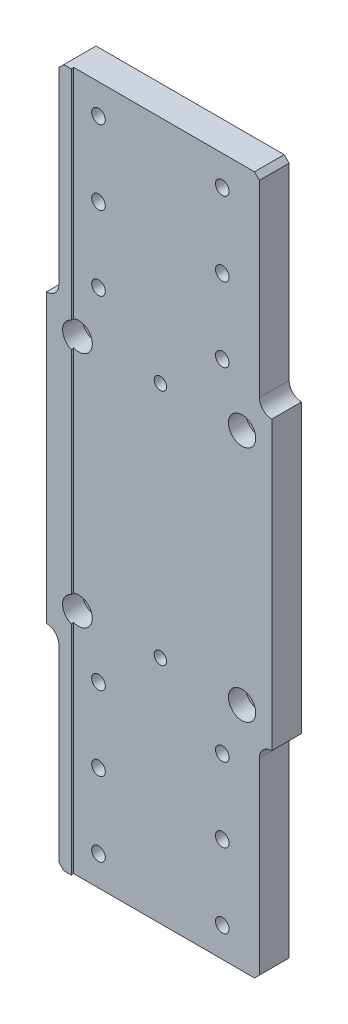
ISO-10303-21;
HEADER;
FILE_DESCRIPTION(('STEP AP214'),'2;1');
FILE_NAME('part.step','',(''),(''),'','','');
FILE_SCHEMA(('AUTOMOTIVE_DESIGN { 1 0 10303 214 1 1 1 1 }'));
ENDSEC;
DATA;
#1=APPLICATION_CONTEXT('core data for automotive mechanical design processes');
#2=APPLICATION_PROTOCOL_DEFINITION('international standard','automotive_design',2000,#1);
#3=PRODUCT_CONTEXT('',#1,'mechanical');
#4=PRODUCT('Part','Part','',(#3));
#5=PRODUCT_RELATED_PRODUCT_CATEGORY('part','',(#4));
#6=PRODUCT_DEFINITION_FORMATION('','',#4);
#7=PRODUCT_DEFINITION_CONTEXT('part definition',#1,'design');
#8=PRODUCT_DEFINITION('design','',#6,#7);
#9=PRODUCT_DEFINITION_SHAPE('','',#8);
#10=(LENGTH_UNIT() NAMED_UNIT(*) SI_UNIT(.MILLI.,.METRE.));
#11=(NAMED_UNIT(*) PLANE_ANGLE_UNIT() SI_UNIT($,.RADIAN.));
#12=(NAMED_UNIT(*) SI_UNIT($,.STERADIAN.) SOLID_ANGLE_UNIT());
#13=UNCERTAINTY_MEASURE_WITH_UNIT(LENGTH_MEASURE(1.E-05),#10,'distance_accuracy_value','');
#14=(GEOMETRIC_REPRESENTATION_CONTEXT(3) GLOBAL_UNCERTAINTY_ASSIGNED_CONTEXT((#13)) GLOBAL_UNIT_ASSIGNED_CONTEXT((#10,
#11,#12)) REPRESENTATION_CONTEXT('',''));
#15=CARTESIAN_POINT('',(0.,0.,0.));
#16=DIRECTION('',(0.,0.,1.));
#17=DIRECTION('',(1.,0.,0.));
#18=AXIS2_PLACEMENT_3D('',#15,#16,#17);
#19=CARTESIAN_POINT('',(0.,0.,-6.5));
#20=DIRECTION('',(0.,0.,1.));
#21=DIRECTION('',(1.,0.,0.));
#22=AXIS2_PLACEMENT_3D('',#19,#20,#21);
#23=PLANE('',#22);
#24=CARTESIAN_POINT('',(0.,48.,-6.50000000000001));
#25=DIRECTION('',(0.,0.,1.));
#26=DIRECTION('',(1.,0.,0.));
#27=AXIS2_PLACEMENT_3D('',#24,#25,#26);
#28=CIRCLE('',#27,2.5);
#29=CARTESIAN_POINT('',(2.5,48.,-6.50000000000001));
#30=VERTEX_POINT('',#29);
#31=EDGE_CURVE('E1306',#30,#30,#28,.T.);
#32=ORIENTED_EDGE('',*,*,#31,.T.);
#33=EDGE_LOOP('',(#32));
#34=FACE_BOUND('',#33,.T.);
#35=CARTESIAN_POINT('',(0.,-48.,-6.50000000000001));
#36=DIRECTION('',(0.,0.,1.));
#37=DIRECTION('',(1.,0.,0.));
#38=AXIS2_PLACEMENT_3D('',#35,#36,#37);
#39=CIRCLE('',#38,2.5);
#40=CARTESIAN_POINT('',(2.5,-48.,-6.50000000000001));
#41=VERTEX_POINT('',#40);
#42=EDGE_CURVE('E1300',#41,#41,#39,.T.);
#43=ORIENTED_EDGE('',*,*,#42,.T.);
#44=EDGE_LOOP('',(#43));
#45=FACE_BOUND('',#44,.T.);
#46=CARTESIAN_POINT('',(-25.,-69.,-6.5));
#47=DIRECTION('',(0.,0.,-1.));
#48=DIRECTION('',(-1.,0.,0.));
#49=AXIS2_PLACEMENT_3D('',#46,#47,#48);
#50=CIRCLE('',#49,4.75);
#51=CARTESIAN_POINT('',(-29.75,-69.,-6.5));
#52=VERTEX_POINT('',#51);
#53=EDGE_CURVE('E1297',#52,#52,#50,.T.);
#54=ORIENTED_EDGE('',*,*,#53,.F.);
#55=EDGE_LOOP('',(#54));
#56=FACE_BOUND('',#55,.T.);
#57=CARTESIAN_POINT('',(25.,-99.,-6.5));
#58=DIRECTION('',(0.,0.,-1.));
#59=DIRECTION('',(-1.,0.,0.));
#60=AXIS2_PLACEMENT_3D('',#57,#58,#59);
#61=CIRCLE('',#60,4.75);
#62=CARTESIAN_POINT('',(20.25,-99.,-6.5));
#63=VERTEX_POINT('',#62);
#64=EDGE_CURVE('E1285',#63,#63,#61,.T.);
#65=ORIENTED_EDGE('',*,*,#64,.F.);
#66=EDGE_LOOP('',(#65));
#67=FACE_BOUND('',#66,.T.);
#68=CARTESIAN_POINT('',(-25.,-99.,-6.5));
#69=DIRECTION('',(0.,0.,-1.));
#70=DIRECTION('',(-1.,0.,0.));
#71=AXIS2_PLACEMENT_3D('',#68,#69,#70);
#72=CIRCLE('',#71,4.75);
#73=CARTESIAN_POINT('',(-29.75,-99.,-6.5));
#74=VERTEX_POINT('',#73);
#75=EDGE_CURVE('E1273',#74,#74,#72,.T.);
#76=ORIENTED_EDGE('',*,*,#75,.F.);
#77=EDGE_LOOP('',(#76));
#78=FACE_BOUND('',#77,.T.);
#79=CARTESIAN_POINT('',(25.,-129.,-6.5));
#80=DIRECTION('',(0.,0.,-1.));
#81=DIRECTION('',(-1.,0.,0.));
#82=AXIS2_PLACEMENT_3D('',#79,#80,#81);
#83=CIRCLE('',#82,4.75);
#84=CARTESIAN_POINT('',(20.25,-129.,-6.5));
#85=VERTEX_POINT('',#84);
#86=EDGE_CURVE('E1261',#85,#85,#83,.T.);
#87=ORIENTED_EDGE('',*,*,#86,.F.);
#88=EDGE_LOOP('',(#87));
#89=FACE_BOUND('',#88,.T.);
#90=CARTESIAN_POINT('',(-25.,-129.,-6.5));
#91=DIRECTION('',(0.,0.,-1.));
#92=DIRECTION('',(-1.,0.,0.));
#93=AXIS2_PLACEMENT_3D('',#90,#91,#92);
#94=CIRCLE('',#93,4.75);
#95=CARTESIAN_POINT('',(-29.75,-129.,-6.5));
#96=VERTEX_POINT('',#95);
#97=EDGE_CURVE('E1249',#96,#96,#94,.T.);
#98=ORIENTED_EDGE('',*,*,#97,.F.);
#99=EDGE_LOOP('',(#98));
#100=FACE_BOUND('',#99,.T.);
#101=CARTESIAN_POINT('',(25.,-69.,-6.5));
#102=DIRECTION('',(0.,0.,-1.));
#103=DIRECTION('',(-1.,0.,0.));
#104=AXIS2_PLACEMENT_3D('',#101,#102,#103);
#105=CIRCLE('',#104,4.75);
#106=CARTESIAN_POINT('',(20.25,-69.,-6.5));
#107=VERTEX_POINT('',#106);
#108=EDGE_CURVE('E1237',#107,#107,#105,.T.);
#109=ORIENTED_EDGE('',*,*,#108,.F.);
#110=EDGE_LOOP('',(#109));
#111=FACE_BOUND('',#110,.T.);
#112=CARTESIAN_POINT('',(-25.,129.,-6.5));
#113=DIRECTION('',(0.,0.,-1.));
#114=DIRECTION('',(-1.,0.,0.));
#115=AXIS2_PLACEMENT_3D('',#112,#113,#114);
#116=CIRCLE('',#115,4.75);
#117=CARTESIAN_POINT('',(-29.75,129.,-6.5));
#118=VERTEX_POINT('',#117);
#119=EDGE_CURVE('E276',#118,#118,#116,.T.);
#120=ORIENTED_EDGE('',*,*,#119,.F.);
#121=EDGE_LOOP('',(#120));
#122=FACE_BOUND('',#121,.T.);
#123=CARTESIAN_POINT('',(25.,99.,-6.5));
#124=DIRECTION('',(0.,0.,-1.));
#125=DIRECTION('',(-1.,0.,0.));
#126=AXIS2_PLACEMENT_3D('',#123,#124,#125);
#127=CIRCLE('',#126,4.75);
#128=CARTESIAN_POINT('',(20.25,99.,-6.5));
#129=VERTEX_POINT('',#128);
#130=EDGE_CURVE('E271',#129,#129,#127,.T.);
#131=ORIENTED_EDGE('',*,*,#130,.F.);
#132=EDGE_LOOP('',(#131));
#133=FACE_BOUND('',#132,.T.);
#134=CARTESIAN_POINT('',(-25.,99.,-6.5));
#135=DIRECTION('',(0.,0.,-1.));
#136=DIRECTION('',(-1.,0.,0.));
#137=AXIS2_PLACEMENT_3D('',#134,#135,#136);
#138=CIRCLE('',#137,4.75);
#139=CARTESIAN_POINT('',(-29.75,99.,-6.5));
#140=VERTEX_POINT('',#139);
#141=EDGE_CURVE('E266',#140,#140,#138,.T.);
#142=ORIENTED_EDGE('',*,*,#141,.F.);
#143=EDGE_LOOP('',(#142));
#144=FACE_BOUND('',#143,.T.);
#145=CARTESIAN_POINT('',(25.,69.,-6.5));
#146=DIRECTION('',(0.,0.,-1.));
#147=DIRECTION('',(-1.,0.,0.));
#148=AXIS2_PLACEMENT_3D('',#145,#146,#147);
#149=CIRCLE('',#148,4.75);
#150=CARTESIAN_POINT('',(20.25,69.,-6.5));
#151=VERTEX_POINT('',#150);
#152=EDGE_CURVE('E261',#151,#151,#149,.T.);
#153=ORIENTED_EDGE('',*,*,#152,.F.);
#154=EDGE_LOOP('',(#153));
#155=FACE_BOUND('',#154,.T.);
#156=CARTESIAN_POINT('',(-33.,48.,-6.5));
#157=DIRECTION('',(0.,0.,1.));
#158=DIRECTION('',(1.,0.,0.));
#159=AXIS2_PLACEMENT_3D('',#156,#157,#158);
#160=CIRCLE('',#159,3.3);
#161=CARTESIAN_POINT('',(-29.7,48.,-6.5));
#162=VERTEX_POINT('',#161);
#163=EDGE_CURVE('E194',#162,#162,#160,.T.);
#164=ORIENTED_EDGE('',*,*,#163,.T.);
#165=EDGE_LOOP('',(#164));
#166=FACE_BOUND('',#165,.T.);
#167=CARTESIAN_POINT('',(33.,48.,-6.5));
#168=DIRECTION('',(0.,0.,1.));
#169=DIRECTION('',(1.,0.,0.));
#170=AXIS2_PLACEMENT_3D('',#167,#168,#169);
#171=CIRCLE('',#170,3.3);
#172=CARTESIAN_POINT('',(36.3,48.,-6.5));
#173=VERTEX_POINT('',#172);
#174=EDGE_CURVE('E247',#173,#173,#171,.T.);
#175=ORIENTED_EDGE('',*,*,#174,.T.);
#176=EDGE_LOOP('',(#175));
#177=FACE_BOUND('',#176,.T.);
#178=CARTESIAN_POINT('',(-33.,-48.,-6.5));
#179=DIRECTION('',(0.,0.,1.));
#180=DIRECTION('',(1.,0.,0.));
#181=AXIS2_PLACEMENT_3D('',#178,#179,#180);
#182=CIRCLE('',#181,3.3);
#183=CARTESIAN_POINT('',(-29.7,-48.,-6.5));
#184=VERTEX_POINT('',#183);
#185=EDGE_CURVE('E1147',#184,#184,#182,.T.);
#186=ORIENTED_EDGE('',*,*,#185,.T.);
#187=EDGE_LOOP('',(#186));
#188=FACE_BOUND('',#187,.T.);
#189=CARTESIAN_POINT('',(33.,-48.,-6.5));
#190=DIRECTION('',(0.,0.,1.));
#191=DIRECTION('',(1.,0.,0.));
#192=AXIS2_PLACEMENT_3D('',#189,#190,#191);
#193=CIRCLE('',#192,3.3);
#194=CARTESIAN_POINT('',(36.3,-48.,-6.5));
#195=VERTEX_POINT('',#194);
#196=EDGE_CURVE('E226',#195,#195,#193,.T.);
#197=ORIENTED_EDGE('',*,*,#196,.T.);
#198=EDGE_LOOP('',(#197));
#199=FACE_BOUND('',#198,.T.);
#200=DIRECTION('',(0.,-1.,0.));
#201=VECTOR('',#200,1.);
#202=CARTESIAN_POINT('',(40.,0.,-6.5));
#203=LINE('',#202,#201);
#204=CARTESIAN_POINT('',(40.,-63.,-6.5));
#205=VERTEX_POINT('',#204);
#206=CARTESIAN_POINT('',(40.,-139.,-6.5));
#207=VERTEX_POINT('',#206);
#208=EDGE_CURVE('E362',#205,#207,#203,.T.);
#209=ORIENTED_EDGE('',*,*,#208,.T.);
#210=DIRECTION('',(-0.707106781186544,-0.707106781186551,0.));
#211=VECTOR('',#210,1.);
#212=CARTESIAN_POINT('',(40.,-139.,-6.5));
#213=LINE('',#212,#211);
#214=CARTESIAN_POINT('',(38.,-141.,-6.5));
#215=VERTEX_POINT('',#214);
#216=EDGE_CURVE('E315',#207,#215,#213,.T.);
#217=ORIENTED_EDGE('',*,*,#216,.T.);
#218=DIRECTION('',(1.,0.,0.));
#219=VECTOR('',#218,1.);
#220=CARTESIAN_POINT('',(0.,-141.,-6.5));
#221=LINE('',#220,#219);
#222=CARTESIAN_POINT('',(-38.,-141.,-6.5));
#223=VERTEX_POINT('',#222);
#224=EDGE_CURVE('E360',#223,#215,#221,.T.);
#225=ORIENTED_EDGE('',*,*,#224,.F.);
#226=DIRECTION('',(0.707106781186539,-0.707106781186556,0.));
#227=VECTOR('',#226,1.);
#228=CARTESIAN_POINT('',(-38.,-141.,-6.5));
#229=LINE('',#228,#227);
#230=CARTESIAN_POINT('',(-40.,-139.,-6.5));
#231=VERTEX_POINT('',#230);
#232=EDGE_CURVE('E313',#223,#231,#229,.F.);
#233=ORIENTED_EDGE('',*,*,#232,.T.);
#234=DIRECTION('',(0.,-1.,0.));
#235=VECTOR('',#234,1.);
#236=CARTESIAN_POINT('',(-40.,0.,-6.5));
#237=LINE('',#236,#235);
#238=CARTESIAN_POINT('',(-40.,-63.,-6.5));
#239=VERTEX_POINT('',#238);
#240=EDGE_CURVE('E364',#239,#231,#237,.T.);
#241=ORIENTED_EDGE('',*,*,#240,.F.);
#242=CARTESIAN_POINT('',(-45.,-63.,-6.5));
#243=DIRECTION('',(0.,0.,1.));
#244=DIRECTION('',(1.,0.,0.));
#245=AXIS2_PLACEMENT_3D('',#242,#243,#244);
#246=CIRCLE('',#245,5.);
#247=CARTESIAN_POINT('',(-45.,-58.,-6.5));
#248=VERTEX_POINT('',#247);
#249=EDGE_CURVE('E288',#239,#248,#246,.T.);
#250=ORIENTED_EDGE('',*,*,#249,.T.);
#251=DIRECTION('',(0.,-1.,0.));
#252=VECTOR('',#251,1.);
#253=CARTESIAN_POINT('',(-45.,58.,-6.5));
#254=LINE('',#253,#252);
#255=CARTESIAN_POINT('',(-45.,58.,-6.5));
#256=VERTEX_POINT('',#255);
#257=EDGE_CURVE('E372',#256,#248,#254,.T.);
#258=ORIENTED_EDGE('',*,*,#257,.F.);
#259=CARTESIAN_POINT('',(-45.,63.,-6.5));
#260=DIRECTION('',(0.,0.,1.));
#261=DIRECTION('',(1.,0.,0.));
#262=AXIS2_PLACEMENT_3D('',#259,#260,#261);
#263=CIRCLE('',#262,5.);
#264=CARTESIAN_POINT('',(-40.,63.,-6.5));
#265=VERTEX_POINT('',#264);
#266=EDGE_CURVE('E292',#256,#265,#263,.T.);
#267=ORIENTED_EDGE('',*,*,#266,.T.);
#268=DIRECTION('',(0.,-1.,0.));
#269=VECTOR('',#268,1.);
#270=CARTESIAN_POINT('',(-40.,0.,-6.5));
#271=LINE('',#270,#269);
#272=CARTESIAN_POINT('',(-40.,139.,-6.5));
#273=VERTEX_POINT('',#272);
#274=EDGE_CURVE('E349',#273,#265,#271,.T.);
#275=ORIENTED_EDGE('',*,*,#274,.F.);
#276=DIRECTION('',(0.707106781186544,0.707106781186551,0.));
#277=VECTOR('',#276,1.);
#278=CARTESIAN_POINT('',(-40.,139.,-6.5));
#279=LINE('',#278,#277);
#280=CARTESIAN_POINT('',(-38.,141.,-6.5));
#281=VERTEX_POINT('',#280);
#282=EDGE_CURVE('E311',#273,#281,#279,.T.);
#283=ORIENTED_EDGE('',*,*,#282,.T.);
#284=DIRECTION('',(1.,0.,0.));
#285=VECTOR('',#284,1.);
#286=CARTESIAN_POINT('',(0.,141.,-6.5));
#287=LINE('',#286,#285);
#288=CARTESIAN_POINT('',(38.,141.,-6.5));
#289=VERTEX_POINT('',#288);
#290=EDGE_CURVE('E340',#281,#289,#287,.T.);
#291=ORIENTED_EDGE('',*,*,#290,.T.);
#292=DIRECTION('',(-0.707106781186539,0.707106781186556,0.));
#293=VECTOR('',#292,1.);
#294=CARTESIAN_POINT('',(38.,141.,-6.5));
#295=LINE('',#294,#293);
#296=CARTESIAN_POINT('',(40.,139.,-6.5));
#297=VERTEX_POINT('',#296);
#298=EDGE_CURVE('E309',#289,#297,#295,.F.);
#299=ORIENTED_EDGE('',*,*,#298,.T.);
#300=DIRECTION('',(0.,-1.,0.));
#301=VECTOR('',#300,1.);
#302=CARTESIAN_POINT('',(40.,0.,-6.5));
#303=LINE('',#302,#301);
#304=CARTESIAN_POINT('',(40.,63.,-6.5));
#305=VERTEX_POINT('',#304);
#306=EDGE_CURVE('E350',#297,#305,#303,.T.);
#307=ORIENTED_EDGE('',*,*,#306,.T.);
#308=CARTESIAN_POINT('',(45.,63.,-6.5));
#309=DIRECTION('',(0.,0.,1.));
#310=DIRECTION('',(1.,0.,0.));
#311=AXIS2_PLACEMENT_3D('',#308,#309,#310);
#312=CIRCLE('',#311,5.);
#313=CARTESIAN_POINT('',(45.,58.,-6.5));
#314=VERTEX_POINT('',#313);
#315=EDGE_CURVE('E301',#305,#314,#312,.T.);
#316=ORIENTED_EDGE('',*,*,#315,.T.);
#317=DIRECTION('',(0.,-1.,0.));
#318=VECTOR('',#317,1.);
#319=CARTESIAN_POINT('',(45.,58.,-6.5));
#320=LINE('',#319,#318);
#321=CARTESIAN_POINT('',(45.,-58.,-6.5));
#322=VERTEX_POINT('',#321);
#323=EDGE_CURVE('E373',#314,#322,#320,.T.);
#324=ORIENTED_EDGE('',*,*,#323,.T.);
#325=CARTESIAN_POINT('',(45.,-63.,-6.5));
#326=DIRECTION('',(0.,0.,1.));
#327=DIRECTION('',(1.,0.,0.));
#328=AXIS2_PLACEMENT_3D('',#325,#326,#327);
#329=CIRCLE('',#328,5.);
#330=EDGE_CURVE('E297',#322,#205,#329,.T.);
#331=ORIENTED_EDGE('',*,*,#330,.T.);
#332=EDGE_LOOP('',(#209,#217,#225,#233,#241,#250,#258,#267,#275,#283,#291,#299,#307,#316,#324,#331));
#333=FACE_BOUND('',#332,.T.);
#334=CARTESIAN_POINT('',(-25.,69.,-6.5));
#335=DIRECTION('',(0.,0.,-1.));
#336=DIRECTION('',(-1.,0.,0.));
#337=AXIS2_PLACEMENT_3D('',#334,#335,#336);
#338=CIRCLE('',#337,4.75);
#339=CARTESIAN_POINT('',(-29.75,69.,-6.5));
#340=VERTEX_POINT('',#339);
#341=EDGE_CURVE('E256',#340,#340,#338,.T.);
#342=ORIENTED_EDGE('',*,*,#341,.F.);
#343=EDGE_LOOP('',(#342));
#344=FACE_BOUND('',#343,.T.);
#345=CARTESIAN_POINT('',(25.,129.,-6.5));
#346=DIRECTION('',(0.,0.,-1.));
#347=DIRECTION('',(-1.,0.,0.));
#348=AXIS2_PLACEMENT_3D('',#345,#346,#347);
#349=CIRCLE('',#348,4.75);
#350=CARTESIAN_POINT('',(20.25,129.,-6.5));
#351=VERTEX_POINT('',#350);
#352=EDGE_CURVE('E1225',#351,#351,#349,.T.);
#353=ORIENTED_EDGE('',*,*,#352,.F.);
#354=EDGE_LOOP('',(#353));
#355=FACE_BOUND('',#354,.T.);
#356=ADVANCED_FACE('F35',(#34,#45,#56,#67,#78,#89,#100,#111,#122,#133,#144,#155,#166,#177,#188,
#199,#333,#344,#355),#23,.F.);
#357=CARTESIAN_POINT('',(-35.,141.,5.5));
#358=DIRECTION('',(-1.,0.,0.));
#359=DIRECTION('',(0.,-1.,0.));
#360=AXIS2_PLACEMENT_3D('',#357,#358,#359);
#361=PLANE('',#360);
#362=DIRECTION('',(0.,-1.,0.));
#363=VECTOR('',#362,1.);
#364=CARTESIAN_POINT('',(-35.,141.,5.5));
#365=LINE('',#364,#363);
#366=CARTESIAN_POINT('',(-35.,42.8765246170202,5.5));
#367=VERTEX_POINT('',#366);
#368=CARTESIAN_POINT('',(-35.,-42.8765246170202,5.5));
#369=VERTEX_POINT('',#368);
#370=EDGE_CURVE('E213',#367,#369,#365,.T.);
#371=ORIENTED_EDGE('',*,*,#370,.F.);
#372=DIRECTION('',(0.,0.,1.));
#373=VECTOR('',#372,1.);
#374=CARTESIAN_POINT('',(-35.,42.8765246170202,6.5));
#375=LINE('',#374,#373);
#376=CARTESIAN_POINT('',(-35.,42.8765246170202,6.5));
#377=VERTEX_POINT('',#376);
#378=EDGE_CURVE('E193',#367,#377,#375,.T.);
#379=ORIENTED_EDGE('',*,*,#378,.T.);
#380=DIRECTION('',(0.,-1.,0.));
#381=VECTOR('',#380,1.);
#382=CARTESIAN_POINT('',(-35.,141.,6.5));
#383=LINE('',#382,#381);
#384=CARTESIAN_POINT('',(-35.,-42.8765246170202,6.5));
#385=VERTEX_POINT('',#384);
#386=EDGE_CURVE('E202',#377,#385,#383,.T.);
#387=ORIENTED_EDGE('',*,*,#386,.T.);
#388=DIRECTION('',(0.,0.,1.));
#389=VECTOR('',#388,1.);
#390=CARTESIAN_POINT('',(-35.,-42.8765246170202,6.5));
#391=LINE('',#390,#389);
#392=EDGE_CURVE('E237',#385,#369,#391,.F.);
#393=ORIENTED_EDGE('',*,*,#392,.T.);
#394=EDGE_LOOP('',(#371,#379,#387,#393));
#395=FACE_BOUND('',#394,.T.);
#396=ADVANCED_FACE('F465',(#395),#361,.F.);
#397=CARTESIAN_POINT('',(-35.,-53.1234753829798,5.5));
#398=VERTEX_POINT('',#397);
#399=CARTESIAN_POINT('',(-35.,-141.,5.5));
#400=VERTEX_POINT('',#399);
#401=EDGE_CURVE('E210',#398,#400,#365,.T.);
#402=ORIENTED_EDGE('',*,*,#401,.F.);
#403=DIRECTION('',(0.,0.,1.));
#404=VECTOR('',#403,1.);
#405=CARTESIAN_POINT('',(-35.,-53.1234753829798,6.5));
#406=LINE('',#405,#404);
#407=CARTESIAN_POINT('',(-35.,-53.1234753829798,6.5));
#408=VERTEX_POINT('',#407);
#409=EDGE_CURVE('E240',#398,#408,#406,.T.);
#410=ORIENTED_EDGE('',*,*,#409,.T.);
#411=CARTESIAN_POINT('',(-35.,-141.,6.5));
#412=VERTEX_POINT('',#411);
#413=EDGE_CURVE('E212',#408,#412,#383,.T.);
#414=ORIENTED_EDGE('',*,*,#413,.T.);
#415=DIRECTION('',(0.,0.,1.));
#416=VECTOR('',#415,1.);
#417=CARTESIAN_POINT('',(-35.,-141.,5.5));
#418=LINE('',#417,#416);
#419=EDGE_CURVE('E411',#400,#412,#418,.T.);
#420=ORIENTED_EDGE('',*,*,#419,.F.);
#421=EDGE_LOOP('',(#402,#410,#414,#420));
#422=FACE_BOUND('',#421,.T.);
#423=ADVANCED_FACE('F471',(#422),#361,.F.);
#424=CARTESIAN_POINT('',(40.,0.,6.5));
#425=DIRECTION('',(1.,0.,0.));
#426=DIRECTION('',(0.,0.,-1.));
#427=AXIS2_PLACEMENT_3D('',#424,#425,#426);
#428=PLANE('',#427);
#429=ORIENTED_EDGE('',*,*,#306,.F.);
#430=DIRECTION('',(0.,0.,1.));
#431=VECTOR('',#430,1.);
#432=CARTESIAN_POINT('',(40.,139.,6.5));
#433=LINE('',#432,#431);
#434=CARTESIAN_POINT('',(40.,139.,5.5));
#435=VERTEX_POINT('',#434);
#436=EDGE_CURVE('E11',#297,#435,#433,.T.);
#437=ORIENTED_EDGE('',*,*,#436,.T.);
#438=DIRECTION('',(0.,-1.,0.));
#439=VECTOR('',#438,1.);
#440=CARTESIAN_POINT('',(40.,0.,5.5));
#441=LINE('',#440,#439);
#442=CARTESIAN_POINT('',(40.,63.,5.5));
#443=VERTEX_POINT('',#442);
#444=EDGE_CURVE('E407',#435,#443,#441,.T.);
#445=ORIENTED_EDGE('',*,*,#444,.T.);
#446=DIRECTION('',(0.,0.,-1.));
#447=VECTOR('',#446,1.);
#448=CARTESIAN_POINT('',(40.,63.,-6.5));
#449=LINE('',#448,#447);
#450=EDGE_CURVE('E285',#443,#305,#449,.T.);
#451=ORIENTED_EDGE('',*,*,#450,.T.);
#452=EDGE_LOOP('',(#429,#437,#445,#451));
#453=FACE_BOUND('',#452,.T.);
#454=ADVANCED_FACE('F401',(#453),#428,.T.);
#455=CARTESIAN_POINT('',(40.,0.,6.5));
#456=DIRECTION('',(1.,0.,0.));
#457=DIRECTION('',(0.,0.,-1.));
#458=AXIS2_PLACEMENT_3D('',#455,#456,#457);
#459=PLANE('',#458);
#460=DIRECTION('',(0.,-1.,0.));
#461=VECTOR('',#460,1.);
#462=CARTESIAN_POINT('',(40.,0.,5.5));
#463=LINE('',#462,#461);
#464=CARTESIAN_POINT('',(40.,-63.,5.5));
#465=VERTEX_POINT('',#464);
#466=CARTESIAN_POINT('',(40.,-139.,5.5));
#467=VERTEX_POINT('',#466);
#468=EDGE_CURVE('E376',#465,#467,#463,.T.);
#469=ORIENTED_EDGE('',*,*,#468,.T.);
#470=DIRECTION('',(0.,0.,-1.));
#471=VECTOR('',#470,1.);
#472=CARTESIAN_POINT('',(40.,-139.,-6.5));
#473=LINE('',#472,#471);
#474=EDGE_CURVE('E306',#467,#207,#473,.T.);
#475=ORIENTED_EDGE('',*,*,#474,.T.);
#476=ORIENTED_EDGE('',*,*,#208,.F.);
#477=DIRECTION('',(0.,0.,-1.));
#478=VECTOR('',#477,1.);
#479=CARTESIAN_POINT('',(40.,-63.,6.5));
#480=LINE('',#479,#478);
#481=EDGE_CURVE('E283',#205,#465,#480,.F.);
#482=ORIENTED_EDGE('',*,*,#481,.T.);
#483=EDGE_LOOP('',(#469,#475,#476,#482));
#484=FACE_BOUND('',#483,.T.);
#485=ADVANCED_FACE('F450',(#484),#459,.T.);
#486=CARTESIAN_POINT('',(45.,58.,6.5));
#487=DIRECTION('',(1.,0.,0.));
#488=DIRECTION('',(0.,0.,-1.));
#489=AXIS2_PLACEMENT_3D('',#486,#487,#488);
#490=PLANE('',#489);
#491=DIRECTION('',(0.,0.,-1.));
#492=VECTOR('',#491,1.);
#493=CARTESIAN_POINT('',(45.,58.,6.5));
#494=LINE('',#493,#492);
#495=CARTESIAN_POINT('',(45.,58.,5.5));
#496=VERTEX_POINT('',#495);
#497=EDGE_CURVE('E235',#496,#314,#494,.T.);
#498=ORIENTED_EDGE('',*,*,#497,.F.);
#499=DIRECTION('',(0.,1.,0.));
#500=VECTOR('',#499,1.);
#501=CARTESIAN_POINT('',(45.,141.,5.5));
#502=LINE('',#501,#500);
#503=CARTESIAN_POINT('',(45.,-58.,5.5));
#504=VERTEX_POINT('',#503);
#505=EDGE_CURVE('E397',#504,#496,#502,.T.);
#506=ORIENTED_EDGE('',*,*,#505,.F.);
#507=DIRECTION('',(0.,0.,-1.));
#508=VECTOR('',#507,1.);
#509=CARTESIAN_POINT('',(45.,-58.,6.5));
#510=LINE('',#509,#508);
#511=EDGE_CURVE('E383',#504,#322,#510,.T.);
#512=ORIENTED_EDGE('',*,*,#511,.T.);
#513=ORIENTED_EDGE('',*,*,#323,.F.);
#514=EDGE_LOOP('',(#498,#506,#512,#513));
#515=FACE_BOUND('',#514,.T.);
#516=ADVANCED_FACE('F396',(#515),#490,.T.);
#517=CARTESIAN_POINT('',(0.,141.,6.5));
#518=DIRECTION('',(0.,1.,0.));
#519=DIRECTION('',(0.,0.,1.));
#520=AXIS2_PLACEMENT_3D('',#517,#518,#519);
#521=PLANE('',#520);
#522=ORIENTED_EDGE('',*,*,#290,.F.);
#523=DIRECTION('',(0.,0.,1.));
#524=VECTOR('',#523,1.);
#525=CARTESIAN_POINT('',(-38.,141.,6.5));
#526=LINE('',#525,#524);
#527=CARTESIAN_POINT('',(-38.,141.,6.5));
#528=VERTEX_POINT('',#527);
#529=EDGE_CURVE('E43',#281,#528,#526,.T.);
#530=ORIENTED_EDGE('',*,*,#529,.T.);
#531=DIRECTION('',(1.,0.,0.));
#532=VECTOR('',#531,1.);
#533=CARTESIAN_POINT('',(0.,141.,6.5));
#534=LINE('',#533,#532);
#535=CARTESIAN_POINT('',(-35.,141.,6.5));
#536=VERTEX_POINT('',#535);
#537=EDGE_CURVE('E352',#528,#536,#534,.T.);
#538=ORIENTED_EDGE('',*,*,#537,.T.);
#539=DIRECTION('',(0.,0.,1.));
#540=VECTOR('',#539,1.);
#541=CARTESIAN_POINT('',(-35.,141.,5.5));
#542=LINE('',#541,#540);
#543=CARTESIAN_POINT('',(-35.,141.,5.5));
#544=VERTEX_POINT('',#543);
#545=EDGE_CURVE('E209',#544,#536,#542,.T.);
#546=ORIENTED_EDGE('',*,*,#545,.F.);
#547=DIRECTION('',(-1.,0.,0.));
#548=VECTOR('',#547,1.);
#549=CARTESIAN_POINT('',(-35.,141.,5.5));
#550=LINE('',#549,#548);
#551=CARTESIAN_POINT('',(38.,141.,5.5));
#552=VERTEX_POINT('',#551);
#553=EDGE_CURVE('E341',#552,#544,#550,.T.);
#554=ORIENTED_EDGE('',*,*,#553,.F.);
#555=DIRECTION('',(0.,0.,-1.));
#556=VECTOR('',#555,1.);
#557=CARTESIAN_POINT('',(38.,141.,6.5));
#558=LINE('',#557,#556);
#559=EDGE_CURVE('E334',#552,#289,#558,.T.);
#560=ORIENTED_EDGE('',*,*,#559,.T.);
#561=EDGE_LOOP('',(#522,#530,#538,#546,#554,#560));
#562=FACE_BOUND('',#561,.T.);
#563=ADVANCED_FACE('F339',(#562),#521,.T.);
#564=CARTESIAN_POINT('',(-40.,0.,6.5));
#565=DIRECTION('',(1.,0.,0.));
#566=DIRECTION('',(0.,0.,-1.));
#567=AXIS2_PLACEMENT_3D('',#564,#565,#566);
#568=PLANE('',#567);
#569=DIRECTION('',(0.,-1.,0.));
#570=VECTOR('',#569,1.);
#571=CARTESIAN_POINT('',(-40.,0.,6.5));
#572=LINE('',#571,#570);
#573=CARTESIAN_POINT('',(-40.,139.,6.5));
#574=VERTEX_POINT('',#573);
#575=CARTESIAN_POINT('',(-40.,63.,6.5));
#576=VERTEX_POINT('',#575);
#577=EDGE_CURVE('E241',#574,#576,#572,.T.);
#578=ORIENTED_EDGE('',*,*,#577,.F.);
#579=DIRECTION('',(0.,0.,-1.));
#580=VECTOR('',#579,1.);
#581=CARTESIAN_POINT('',(-40.,139.,-6.5));
#582=LINE('',#581,#580);
#583=EDGE_CURVE('E331',#574,#273,#582,.T.);
#584=ORIENTED_EDGE('',*,*,#583,.T.);
#585=ORIENTED_EDGE('',*,*,#274,.T.);
#586=DIRECTION('',(0.,0.,-1.));
#587=VECTOR('',#586,1.);
#588=CARTESIAN_POINT('',(-40.,63.,6.5));
#589=LINE('',#588,#587);
#590=EDGE_CURVE('E280',#265,#576,#589,.F.);
#591=ORIENTED_EDGE('',*,*,#590,.T.);
#592=EDGE_LOOP('',(#578,#584,#585,#591));
#593=FACE_BOUND('',#592,.T.);
#594=ADVANCED_FACE('F419',(#593),#568,.F.);
#595=CARTESIAN_POINT('',(0.,0.,6.5));
#596=DIRECTION('',(0.,0.,1.));
#597=DIRECTION('',(1.,0.,0.));
#598=AXIS2_PLACEMENT_3D('',#595,#596,#597);
#599=PLANE('',#598);
#600=DIRECTION('',(0.,-1.,0.));
#601=VECTOR('',#600,1.);
#602=CARTESIAN_POINT('',(-40.,0.,6.5));
#603=LINE('',#602,#601);
#604=CARTESIAN_POINT('',(-40.,-63.,6.5));
#605=VERTEX_POINT('',#604);
#606=CARTESIAN_POINT('',(-40.,-139.,6.5));
#607=VERTEX_POINT('',#606);
#608=EDGE_CURVE('E358',#605,#607,#603,.T.);
#609=ORIENTED_EDGE('',*,*,#608,.T.);
#610=DIRECTION('',(-0.707106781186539,0.707106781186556,0.));
#611=VECTOR('',#610,1.);
#612=CARTESIAN_POINT('',(-89.5000000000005,-89.4999999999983,6.5));
#613=LINE('',#612,#611);
#614=CARTESIAN_POINT('',(-38.,-141.,6.5));
#615=VERTEX_POINT('',#614);
#616=EDGE_CURVE('E329',#607,#615,#613,.F.);
#617=ORIENTED_EDGE('',*,*,#616,.T.);
#618=DIRECTION('',(1.,0.,0.));
#619=VECTOR('',#618,1.);
#620=CARTESIAN_POINT('',(0.,-141.,6.5));
#621=LINE('',#620,#619);
#622=EDGE_CURVE('E354',#615,#412,#621,.T.);
#623=ORIENTED_EDGE('',*,*,#622,.T.);
#624=ORIENTED_EDGE('',*,*,#413,.F.);
#625=CARTESIAN_POINT('',(-33.,-48.,6.5));
#626=DIRECTION('',(0.,0.,1.));
#627=DIRECTION('',(1.,0.,0.));
#628=AXIS2_PLACEMENT_3D('',#625,#626,#627);
#629=CIRCLE('',#628,5.5);
#630=EDGE_CURVE('E246',#385,#408,#629,.T.);
#631=ORIENTED_EDGE('',*,*,#630,.F.);
#632=ORIENTED_EDGE('',*,*,#386,.F.);
#633=CARTESIAN_POINT('',(-33.,48.,6.5));
#634=DIRECTION('',(0.,0.,1.));
#635=DIRECTION('',(1.,0.,0.));
#636=AXIS2_PLACEMENT_3D('',#633,#634,#635);
#637=CIRCLE('',#636,5.5);
#638=CARTESIAN_POINT('',(-35.,53.1234753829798,6.5));
#639=VERTEX_POINT('',#638);
#640=EDGE_CURVE('E185',#639,#377,#637,.T.);
#641=ORIENTED_EDGE('',*,*,#640,.F.);
#642=EDGE_CURVE('E200',#536,#639,#383,.T.);
#643=ORIENTED_EDGE('',*,*,#642,.F.);
#644=ORIENTED_EDGE('',*,*,#537,.F.);
#645=DIRECTION('',(-0.707106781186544,-0.707106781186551,0.));
#646=VECTOR('',#645,1.);
#647=CARTESIAN_POINT('',(-89.5000000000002,89.4999999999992,6.5));
#648=LINE('',#647,#646);
#649=EDGE_CURVE('E50',#528,#574,#648,.T.);
#650=ORIENTED_EDGE('',*,*,#649,.T.);
#651=ORIENTED_EDGE('',*,*,#577,.T.);
#652=CARTESIAN_POINT('',(-45.,63.,6.5));
#653=DIRECTION('',(0.,0.,1.));
#654=DIRECTION('',(1.,0.,0.));
#655=AXIS2_PLACEMENT_3D('',#652,#653,#654);
#656=CIRCLE('',#655,5.);
#657=CARTESIAN_POINT('',(-45.,58.,6.5));
#658=VERTEX_POINT('',#657);
#659=EDGE_CURVE('E295',#576,#658,#656,.F.);
#660=ORIENTED_EDGE('',*,*,#659,.T.);
#661=DIRECTION('',(0.,-1.,0.));
#662=VECTOR('',#661,1.);
#663=CARTESIAN_POINT('',(-45.,58.,6.5));
#664=LINE('',#663,#662);
#665=CARTESIAN_POINT('',(-45.,-58.,6.5));
#666=VERTEX_POINT('',#665);
#667=EDGE_CURVE('E370',#658,#666,#664,.T.);
#668=ORIENTED_EDGE('',*,*,#667,.T.);
#669=CARTESIAN_POINT('',(-45.,-63.,6.5));
#670=DIRECTION('',(0.,0.,1.));
#671=DIRECTION('',(1.,0.,0.));
#672=AXIS2_PLACEMENT_3D('',#669,#670,#671);
#673=CIRCLE('',#672,5.);
#674=EDGE_CURVE('E290',#666,#605,#673,.F.);
#675=ORIENTED_EDGE('',*,*,#674,.T.);
#676=EDGE_LOOP('',(#609,#617,#623,#624,#631,#632,#641,#643,#644,#650,#651,#660,#668,#675));
#677=FACE_BOUND('',#676,.T.);
#678=ADVANCED_FACE('F199',(#677),#599,.T.);
#679=CARTESIAN_POINT('',(0.,-141.,6.5));
#680=DIRECTION('',(0.,1.,0.));
#681=DIRECTION('',(0.,0.,1.));
#682=AXIS2_PLACEMENT_3D('',#679,#680,#681);
#683=PLANE('',#682);
#684=ORIENTED_EDGE('',*,*,#224,.T.);
#685=DIRECTION('',(0.,0.,1.));
#686=VECTOR('',#685,1.);
#687=CARTESIAN_POINT('',(38.,-141.,5.5));
#688=LINE('',#687,#686);
#689=CARTESIAN_POINT('',(38.,-141.,5.5));
#690=VERTEX_POINT('',#689);
#691=EDGE_CURVE('E320',#215,#690,#688,.T.);
#692=ORIENTED_EDGE('',*,*,#691,.T.);
#693=DIRECTION('',(1.,0.,0.));
#694=VECTOR('',#693,1.);
#695=CARTESIAN_POINT('',(-35.,-141.,5.5));
#696=LINE('',#695,#694);
#697=EDGE_CURVE('E1140',#400,#690,#696,.T.);
#698=ORIENTED_EDGE('',*,*,#697,.F.);
#699=ORIENTED_EDGE('',*,*,#419,.T.);
#700=ORIENTED_EDGE('',*,*,#622,.F.);
#701=DIRECTION('',(0.,0.,-1.));
#702=VECTOR('',#701,1.);
#703=CARTESIAN_POINT('',(-38.,-141.,6.5));
#704=LINE('',#703,#702);
#705=EDGE_CURVE('E317',#615,#223,#704,.T.);
#706=ORIENTED_EDGE('',*,*,#705,.T.);
#707=EDGE_LOOP('',(#684,#692,#698,#699,#700,#706));
#708=FACE_BOUND('',#707,.T.);
#709=ADVANCED_FACE('F443',(#708),#683,.F.);
#710=CARTESIAN_POINT('',(-40.,0.,6.5));
#711=DIRECTION('',(1.,0.,0.));
#712=DIRECTION('',(0.,0.,-1.));
#713=AXIS2_PLACEMENT_3D('',#710,#711,#712);
#714=PLANE('',#713);
#715=ORIENTED_EDGE('',*,*,#240,.T.);
#716=DIRECTION('',(0.,0.,1.));
#717=VECTOR('',#716,1.);
#718=CARTESIAN_POINT('',(-40.,-139.,6.5));
#719=LINE('',#718,#717);
#720=EDGE_CURVE('E326',#231,#607,#719,.T.);
#721=ORIENTED_EDGE('',*,*,#720,.T.);
#722=ORIENTED_EDGE('',*,*,#608,.F.);
#723=DIRECTION('',(0.,0.,-1.));
#724=VECTOR('',#723,1.);
#725=CARTESIAN_POINT('',(-40.,-63.,-6.5));
#726=LINE('',#725,#724);
#727=EDGE_CURVE('E249',#605,#239,#726,.T.);
#728=ORIENTED_EDGE('',*,*,#727,.T.);
#729=EDGE_LOOP('',(#715,#721,#722,#728));
#730=FACE_BOUND('',#729,.T.);
#731=ADVANCED_FACE('F434',(#730),#714,.F.);
#732=CARTESIAN_POINT('',(-45.,58.,6.5));
#733=DIRECTION('',(1.,0.,0.));
#734=DIRECTION('',(0.,0.,-1.));
#735=AXIS2_PLACEMENT_3D('',#732,#733,#734);
#736=PLANE('',#735);
#737=ORIENTED_EDGE('',*,*,#257,.T.);
#738=DIRECTION('',(0.,0.,-1.));
#739=VECTOR('',#738,1.);
#740=CARTESIAN_POINT('',(-45.,-58.,6.5));
#741=LINE('',#740,#739);
#742=EDGE_CURVE('E381',#666,#248,#741,.T.);
#743=ORIENTED_EDGE('',*,*,#742,.F.);
#744=ORIENTED_EDGE('',*,*,#667,.F.);
#745=DIRECTION('',(0.,0.,-1.));
#746=VECTOR('',#745,1.);
#747=CARTESIAN_POINT('',(-45.,58.,6.5));
#748=LINE('',#747,#746);
#749=EDGE_CURVE('E365',#658,#256,#748,.T.);
#750=ORIENTED_EDGE('',*,*,#749,.T.);
#751=EDGE_LOOP('',(#737,#743,#744,#750));
#752=FACE_BOUND('',#751,.T.);
#753=ADVANCED_FACE('F425',(#752),#736,.F.);
#754=ORIENTED_EDGE('',*,*,#642,.T.);
#755=DIRECTION('',(0.,0.,1.));
#756=VECTOR('',#755,1.);
#757=CARTESIAN_POINT('',(-35.,53.1234753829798,6.5));
#758=LINE('',#757,#756);
#759=CARTESIAN_POINT('',(-35.,53.1234753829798,5.5));
#760=VERTEX_POINT('',#759);
#761=EDGE_CURVE('E182',#639,#760,#758,.F.);
#762=ORIENTED_EDGE('',*,*,#761,.T.);
#763=EDGE_CURVE('E215',#544,#760,#365,.T.);
#764=ORIENTED_EDGE('',*,*,#763,.F.);
#765=ORIENTED_EDGE('',*,*,#545,.T.);
#766=EDGE_LOOP('',(#754,#762,#764,#765));
#767=FACE_BOUND('',#766,.T.);
#768=ADVANCED_FACE('F207',(#767),#361,.F.);
#769=CARTESIAN_POINT('',(0.,0.,5.5));
#770=DIRECTION('',(0.,0.,1.));
#771=DIRECTION('',(1.,0.,0.));
#772=AXIS2_PLACEMENT_3D('',#769,#770,#771);
#773=PLANE('',#772);
#774=CARTESIAN_POINT('',(0.,48.,5.5));
#775=DIRECTION('',(0.,0.,1.));
#776=DIRECTION('',(1.,0.,0.));
#777=AXIS2_PLACEMENT_3D('',#774,#775,#776);
#778=CIRCLE('',#777,2.49999999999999);
#779=CARTESIAN_POINT('',(2.49999999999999,48.,5.5));
#780=VERTEX_POINT('',#779);
#781=EDGE_CURVE('E1308',#780,#780,#778,.T.);
#782=ORIENTED_EDGE('',*,*,#781,.F.);
#783=EDGE_LOOP('',(#782));
#784=FACE_BOUND('',#783,.T.);
#785=CARTESIAN_POINT('',(0.,-48.,5.5));
#786=DIRECTION('',(0.,0.,1.));
#787=DIRECTION('',(1.,0.,0.));
#788=AXIS2_PLACEMENT_3D('',#785,#786,#787);
#789=CIRCLE('',#788,2.49999999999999);
#790=CARTESIAN_POINT('',(2.49999999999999,-48.,5.5));
#791=VERTEX_POINT('',#790);
#792=EDGE_CURVE('E1303',#791,#791,#789,.T.);
#793=ORIENTED_EDGE('',*,*,#792,.F.);
#794=EDGE_LOOP('',(#793));
#795=FACE_BOUND('',#794,.T.);
#796=CARTESIAN_POINT('',(-25.,-69.,5.5));
#797=DIRECTION('',(0.,0.,1.));
#798=DIRECTION('',(1.,0.,0.));
#799=AXIS2_PLACEMENT_3D('',#796,#797,#798);
#800=CIRCLE('',#799,2.75);
#801=CARTESIAN_POINT('',(-22.25,-69.,5.5));
#802=VERTEX_POINT('',#801);
#803=EDGE_CURVE('E1294',#802,#802,#800,.T.);
#804=ORIENTED_EDGE('',*,*,#803,.F.);
#805=EDGE_LOOP('',(#804));
#806=FACE_BOUND('',#805,.T.);
#807=CARTESIAN_POINT('',(25.,-99.,5.5));
#808=DIRECTION('',(0.,0.,1.));
#809=DIRECTION('',(1.,0.,0.));
#810=AXIS2_PLACEMENT_3D('',#807,#808,#809);
#811=CIRCLE('',#810,2.75);
#812=CARTESIAN_POINT('',(27.75,-99.,5.5));
#813=VERTEX_POINT('',#812);
#814=EDGE_CURVE('E1282',#813,#813,#811,.T.);
#815=ORIENTED_EDGE('',*,*,#814,.F.);
#816=EDGE_LOOP('',(#815));
#817=FACE_BOUND('',#816,.T.);
#818=CARTESIAN_POINT('',(-25.,-99.,5.5));
#819=DIRECTION('',(0.,0.,1.));
#820=DIRECTION('',(1.,0.,0.));
#821=AXIS2_PLACEMENT_3D('',#818,#819,#820);
#822=CIRCLE('',#821,2.75);
#823=CARTESIAN_POINT('',(-22.25,-99.,5.5));
#824=VERTEX_POINT('',#823);
#825=EDGE_CURVE('E1270',#824,#824,#822,.T.);
#826=ORIENTED_EDGE('',*,*,#825,.F.);
#827=EDGE_LOOP('',(#826));
#828=FACE_BOUND('',#827,.T.);
#829=CARTESIAN_POINT('',(25.,-129.,5.5));
#830=DIRECTION('',(0.,0.,1.));
#831=DIRECTION('',(1.,0.,0.));
#832=AXIS2_PLACEMENT_3D('',#829,#830,#831);
#833=CIRCLE('',#832,2.75);
#834=CARTESIAN_POINT('',(27.75,-129.,5.5));
#835=VERTEX_POINT('',#834);
#836=EDGE_CURVE('E1258',#835,#835,#833,.T.);
#837=ORIENTED_EDGE('',*,*,#836,.F.);
#838=EDGE_LOOP('',(#837));
#839=FACE_BOUND('',#838,.T.);
#840=CARTESIAN_POINT('',(-25.,-129.,5.5));
#841=DIRECTION('',(0.,0.,1.));
#842=DIRECTION('',(1.,0.,0.));
#843=AXIS2_PLACEMENT_3D('',#840,#841,#842);
#844=CIRCLE('',#843,2.75);
#845=CARTESIAN_POINT('',(-22.25,-129.,5.5));
#846=VERTEX_POINT('',#845);
#847=EDGE_CURVE('E1246',#846,#846,#844,.T.);
#848=ORIENTED_EDGE('',*,*,#847,.F.);
#849=EDGE_LOOP('',(#848));
#850=FACE_BOUND('',#849,.T.);
#851=CARTESIAN_POINT('',(25.,-69.,5.5));
#852=DIRECTION('',(0.,0.,1.));
#853=DIRECTION('',(1.,0.,0.));
#854=AXIS2_PLACEMENT_3D('',#851,#852,#853);
#855=CIRCLE('',#854,2.75);
#856=CARTESIAN_POINT('',(27.75,-69.,5.5));
#857=VERTEX_POINT('',#856);
#858=EDGE_CURVE('E1234',#857,#857,#855,.T.);
#859=ORIENTED_EDGE('',*,*,#858,.F.);
#860=EDGE_LOOP('',(#859));
#861=FACE_BOUND('',#860,.T.);
#862=CARTESIAN_POINT('',(25.,129.,5.5));
#863=DIRECTION('',(0.,0.,1.));
#864=DIRECTION('',(1.,0.,0.));
#865=AXIS2_PLACEMENT_3D('',#862,#863,#864);
#866=CIRCLE('',#865,2.75);
#867=CARTESIAN_POINT('',(27.75,129.,5.5));
#868=VERTEX_POINT('',#867);
#869=EDGE_CURVE('E273',#868,#868,#866,.T.);
#870=ORIENTED_EDGE('',*,*,#869,.F.);
#871=EDGE_LOOP('',(#870));
#872=FACE_BOUND('',#871,.T.);
#873=CARTESIAN_POINT('',(-25.,129.,5.5));
#874=DIRECTION('',(0.,0.,1.));
#875=DIRECTION('',(1.,0.,0.));
#876=AXIS2_PLACEMENT_3D('',#873,#874,#875);
#877=CIRCLE('',#876,2.75);
#878=CARTESIAN_POINT('',(-22.25,129.,5.5));
#879=VERTEX_POINT('',#878);
#880=EDGE_CURVE('E268',#879,#879,#877,.T.);
#881=ORIENTED_EDGE('',*,*,#880,.F.);
#882=EDGE_LOOP('',(#881));
#883=FACE_BOUND('',#882,.T.);
#884=CARTESIAN_POINT('',(25.,99.,5.5));
#885=DIRECTION('',(0.,0.,1.));
#886=DIRECTION('',(1.,0.,0.));
#887=AXIS2_PLACEMENT_3D('',#884,#885,#886);
#888=CIRCLE('',#887,2.75);
#889=CARTESIAN_POINT('',(27.75,99.,5.5));
#890=VERTEX_POINT('',#889);
#891=EDGE_CURVE('E263',#890,#890,#888,.T.);
#892=ORIENTED_EDGE('',*,*,#891,.F.);
#893=EDGE_LOOP('',(#892));
#894=FACE_BOUND('',#893,.T.);
#895=CARTESIAN_POINT('',(-25.,99.,5.5));
#896=DIRECTION('',(0.,0.,1.));
#897=DIRECTION('',(1.,0.,0.));
#898=AXIS2_PLACEMENT_3D('',#895,#896,#897);
#899=CIRCLE('',#898,2.75);
#900=CARTESIAN_POINT('',(-22.25,99.,5.5));
#901=VERTEX_POINT('',#900);
#902=EDGE_CURVE('E258',#901,#901,#899,.T.);
#903=ORIENTED_EDGE('',*,*,#902,.F.);
#904=EDGE_LOOP('',(#903));
#905=FACE_BOUND('',#904,.T.);
#906=CARTESIAN_POINT('',(25.,69.,5.5));
#907=DIRECTION('',(0.,0.,1.));
#908=DIRECTION('',(1.,0.,0.));
#909=AXIS2_PLACEMENT_3D('',#906,#907,#908);
#910=CIRCLE('',#909,2.75);
#911=CARTESIAN_POINT('',(27.75,69.,5.5));
#912=VERTEX_POINT('',#911);
#913=EDGE_CURVE('E253',#912,#912,#910,.T.);
#914=ORIENTED_EDGE('',*,*,#913,.F.);
#915=EDGE_LOOP('',(#914));
#916=FACE_BOUND('',#915,.T.);
#917=CARTESIAN_POINT('',(-25.,69.,5.5));
#918=DIRECTION('',(0.,0.,1.));
#919=DIRECTION('',(1.,0.,0.));
#920=AXIS2_PLACEMENT_3D('',#917,#918,#919);
#921=CIRCLE('',#920,2.75);
#922=CARTESIAN_POINT('',(-22.25,69.,5.5));
#923=VERTEX_POINT('',#922);
#924=EDGE_CURVE('E204',#923,#923,#921,.T.);
#925=ORIENTED_EDGE('',*,*,#924,.F.);
#926=EDGE_LOOP('',(#925));
#927=FACE_BOUND('',#926,.T.);
#928=ORIENTED_EDGE('',*,*,#697,.T.);
#929=DIRECTION('',(0.707106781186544,0.707106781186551,0.));
#930=VECTOR('',#929,1.);
#931=CARTESIAN_POINT('',(89.5000000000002,-89.4999999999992,5.5));
#932=LINE('',#931,#930);
#933=EDGE_CURVE('E324',#690,#467,#932,.T.);
#934=ORIENTED_EDGE('',*,*,#933,.T.);
#935=ORIENTED_EDGE('',*,*,#468,.F.);
#936=CARTESIAN_POINT('',(45.,-63.,5.5));
#937=DIRECTION('',(0.,0.,1.));
#938=DIRECTION('',(1.,0.,0.));
#939=AXIS2_PLACEMENT_3D('',#936,#937,#938);
#940=CIRCLE('',#939,5.);
#941=EDGE_CURVE('E299',#465,#504,#940,.F.);
#942=ORIENTED_EDGE('',*,*,#941,.T.);
#943=ORIENTED_EDGE('',*,*,#505,.T.);
#944=CARTESIAN_POINT('',(45.,63.,5.5));
#945=DIRECTION('',(0.,0.,1.));
#946=DIRECTION('',(1.,0.,0.));
#947=AXIS2_PLACEMENT_3D('',#944,#945,#946);
#948=CIRCLE('',#947,5.);
#949=EDGE_CURVE('E303',#496,#443,#948,.F.);
#950=ORIENTED_EDGE('',*,*,#949,.T.);
#951=ORIENTED_EDGE('',*,*,#444,.F.);
#952=DIRECTION('',(0.707106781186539,-0.707106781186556,0.));
#953=VECTOR('',#952,1.);
#954=CARTESIAN_POINT('',(89.5000000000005,89.4999999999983,5.5));
#955=LINE('',#954,#953);
#956=EDGE_CURVE('E322',#435,#552,#955,.F.);
#957=ORIENTED_EDGE('',*,*,#956,.T.);
#958=ORIENTED_EDGE('',*,*,#553,.T.);
#959=ORIENTED_EDGE('',*,*,#763,.T.);
#960=CARTESIAN_POINT('',(-33.,48.,5.5));
#961=DIRECTION('',(0.,0.,1.));
#962=DIRECTION('',(1.,0.,0.));
#963=AXIS2_PLACEMENT_3D('',#960,#961,#962);
#964=CIRCLE('',#963,5.5);
#965=EDGE_CURVE('E188',#367,#760,#964,.T.);
#966=ORIENTED_EDGE('',*,*,#965,.F.);
#967=ORIENTED_EDGE('',*,*,#370,.T.);
#968=CARTESIAN_POINT('',(-33.,-48.,5.5));
#969=DIRECTION('',(0.,0.,1.));
#970=DIRECTION('',(1.,0.,0.));
#971=AXIS2_PLACEMENT_3D('',#968,#969,#970);
#972=CIRCLE('',#971,5.5);
#973=EDGE_CURVE('E1142',#398,#369,#972,.T.);
#974=ORIENTED_EDGE('',*,*,#973,.F.);
#975=ORIENTED_EDGE('',*,*,#401,.T.);
#976=EDGE_LOOP('',(#928,#934,#935,#942,#943,#950,#951,#957,#958,#959,#966,#967,#974,#975));
#977=FACE_BOUND('',#976,.T.);
#978=CARTESIAN_POINT('',(33.,48.,5.5));
#979=DIRECTION('',(0.,0.,1.));
#980=DIRECTION('',(1.,0.,0.));
#981=AXIS2_PLACEMENT_3D('',#978,#979,#980);
#982=CIRCLE('',#981,5.5);
#983=CARTESIAN_POINT('',(38.5,48.,5.5));
#984=VERTEX_POINT('',#983);
#985=EDGE_CURVE('E243',#984,#984,#982,.T.);
#986=ORIENTED_EDGE('',*,*,#985,.F.);
#987=EDGE_LOOP('',(#986));
#988=FACE_BOUND('',#987,.T.);
#989=CARTESIAN_POINT('',(33.,-48.,5.5));
#990=DIRECTION('',(0.,0.,1.));
#991=DIRECTION('',(1.,0.,0.));
#992=AXIS2_PLACEMENT_3D('',#989,#990,#991);
#993=CIRCLE('',#992,5.5);
#994=CARTESIAN_POINT('',(38.5,-48.,5.5));
#995=VERTEX_POINT('',#994);
#996=EDGE_CURVE('E219',#995,#995,#993,.T.);
#997=ORIENTED_EDGE('',*,*,#996,.F.);
#998=EDGE_LOOP('',(#997));
#999=FACE_BOUND('',#998,.T.);
#1000=ADVANCED_FACE('F405',(#784,#795,#806,#817,#828,#839,#850,#861,#872,#883,#894,#905,#916,
#927,#977,#988,#999),#773,.T.);
#1001=CARTESIAN_POINT('',(33.,-48.,6.5));
#1002=DIRECTION('',(0.,0.,1.));
#1003=DIRECTION('',(1.,0.,0.));
#1004=AXIS2_PLACEMENT_3D('',#1001,#1002,#1003);
#1005=CYLINDRICAL_SURFACE('',#1004,3.3);
#1006=ORIENTED_EDGE('',*,*,#196,.F.);
#1007=EDGE_LOOP('',(#1006));
#1008=FACE_BOUND('',#1007,.T.);
#1009=CARTESIAN_POINT('',(33.,-48.,-1.5));
#1010=DIRECTION('',(0.,0.,1.));
#1011=DIRECTION('',(1.,0.,0.));
#1012=AXIS2_PLACEMENT_3D('',#1009,#1010,#1011);
#1013=CIRCLE('',#1012,3.3);
#1014=CARTESIAN_POINT('',(36.3,-48.,-1.5));
#1015=VERTEX_POINT('',#1014);
#1016=EDGE_CURVE('E231',#1015,#1015,#1013,.T.);
#1017=ORIENTED_EDGE('',*,*,#1016,.T.);
#1018=EDGE_LOOP('',(#1017));
#1019=FACE_BOUND('',#1018,.T.);
#1020=ADVANCED_FACE('F695',(#1008,#1019),#1005,.F.);
#1021=CARTESIAN_POINT('',(36.3,-48.,-1.5));
#1022=DIRECTION('',(0.,0.,-1.));
#1023=DIRECTION('',(-1.,0.,0.));
#1024=AXIS2_PLACEMENT_3D('',#1021,#1022,#1023);
#1025=PLANE('',#1024);
#1026=ORIENTED_EDGE('',*,*,#1016,.F.);
#1027=EDGE_LOOP('',(#1026));
#1028=FACE_BOUND('',#1027,.T.);
#1029=CARTESIAN_POINT('',(33.,-48.,-1.5));
#1030=DIRECTION('',(0.,0.,1.));
#1031=DIRECTION('',(1.,0.,0.));
#1032=AXIS2_PLACEMENT_3D('',#1029,#1030,#1031);
#1033=CIRCLE('',#1032,5.5);
#1034=CARTESIAN_POINT('',(38.5,-48.,-1.5));
#1035=VERTEX_POINT('',#1034);
#1036=EDGE_CURVE('E1146',#1035,#1035,#1033,.T.);
#1037=ORIENTED_EDGE('',*,*,#1036,.T.);
#1038=EDGE_LOOP('',(#1037));
#1039=FACE_BOUND('',#1038,.T.);
#1040=ADVANCED_FACE('F692',(#1028,#1039),#1025,.F.);
#1041=CARTESIAN_POINT('',(33.,-48.,6.5));
#1042=DIRECTION('',(0.,0.,1.));
#1043=DIRECTION('',(1.,0.,0.));
#1044=AXIS2_PLACEMENT_3D('',#1041,#1042,#1043);
#1045=CYLINDRICAL_SURFACE('',#1044,5.5);
#1046=ORIENTED_EDGE('',*,*,#996,.T.);
#1047=EDGE_LOOP('',(#1046));
#1048=FACE_BOUND('',#1047,.T.);
#1049=ORIENTED_EDGE('',*,*,#1036,.F.);
#1050=EDGE_LOOP('',(#1049));
#1051=FACE_BOUND('',#1050,.T.);
#1052=ADVANCED_FACE('F682',(#1048,#1051),#1045,.F.);
#1053=CARTESIAN_POINT('',(-33.,-48.,6.5));
#1054=DIRECTION('',(0.,0.,1.));
#1055=DIRECTION('',(1.,0.,0.));
#1056=AXIS2_PLACEMENT_3D('',#1053,#1054,#1055);
#1057=CYLINDRICAL_SURFACE('',#1056,5.5);
#1058=CARTESIAN_POINT('',(-33.,-48.,-1.5));
#1059=DIRECTION('',(0.,0.,1.));
#1060=DIRECTION('',(1.,0.,0.));
#1061=AXIS2_PLACEMENT_3D('',#1058,#1059,#1060);
#1062=CIRCLE('',#1061,5.5);
#1063=CARTESIAN_POINT('',(-27.5,-48.,-1.5));
#1064=VERTEX_POINT('',#1063);
#1065=EDGE_CURVE('E1159',#1064,#1064,#1062,.T.);
#1066=ORIENTED_EDGE('',*,*,#1065,.F.);
#1067=EDGE_LOOP('',(#1066));
#1068=FACE_BOUND('',#1067,.T.);
#1069=ORIENTED_EDGE('',*,*,#973,.T.);
#1070=ORIENTED_EDGE('',*,*,#392,.F.);
#1071=ORIENTED_EDGE('',*,*,#630,.T.);
#1072=ORIENTED_EDGE('',*,*,#409,.F.);
#1073=EDGE_LOOP('',(#1069,#1070,#1071,#1072));
#1074=FACE_BOUND('',#1073,.T.);
#1075=ADVANCED_FACE('F678',(#1068,#1074),#1057,.F.);
#1076=CARTESIAN_POINT('',(-33.,-48.,6.5));
#1077=DIRECTION('',(0.,0.,1.));
#1078=DIRECTION('',(1.,0.,0.));
#1079=AXIS2_PLACEMENT_3D('',#1076,#1077,#1078);
#1080=CYLINDRICAL_SURFACE('',#1079,3.3);
#1081=ORIENTED_EDGE('',*,*,#185,.F.);
#1082=EDGE_LOOP('',(#1081));
#1083=FACE_BOUND('',#1082,.T.);
#1084=CARTESIAN_POINT('',(-33.,-48.,-1.5));
#1085=DIRECTION('',(0.,0.,1.));
#1086=DIRECTION('',(1.,0.,0.));
#1087=AXIS2_PLACEMENT_3D('',#1084,#1085,#1086);
#1088=CIRCLE('',#1087,3.3);
#1089=CARTESIAN_POINT('',(-29.7,-48.,-1.5));
#1090=VERTEX_POINT('',#1089);
#1091=EDGE_CURVE('E1152',#1090,#1090,#1088,.T.);
#1092=ORIENTED_EDGE('',*,*,#1091,.T.);
#1093=EDGE_LOOP('',(#1092));
#1094=FACE_BOUND('',#1093,.T.);
#1095=ADVANCED_FACE('F681',(#1083,#1094),#1080,.F.);
#1096=CARTESIAN_POINT('',(-29.7,-48.,-1.5));
#1097=DIRECTION('',(0.,0.,-1.));
#1098=DIRECTION('',(-1.,0.,0.));
#1099=AXIS2_PLACEMENT_3D('',#1096,#1097,#1098);
#1100=PLANE('',#1099);
#1101=ORIENTED_EDGE('',*,*,#1091,.F.);
#1102=EDGE_LOOP('',(#1101));
#1103=FACE_BOUND('',#1102,.T.);
#1104=ORIENTED_EDGE('',*,*,#1065,.T.);
#1105=EDGE_LOOP('',(#1104));
#1106=FACE_BOUND('',#1105,.T.);
#1107=ADVANCED_FACE('F676',(#1103,#1106),#1100,.F.);
#1108=CARTESIAN_POINT('',(33.,48.,6.5));
#1109=DIRECTION('',(0.,0.,1.));
#1110=DIRECTION('',(1.,0.,0.));
#1111=AXIS2_PLACEMENT_3D('',#1108,#1109,#1110);
#1112=CYLINDRICAL_SURFACE('',#1111,3.3);
#1113=ORIENTED_EDGE('',*,*,#174,.F.);
#1114=EDGE_LOOP('',(#1113));
#1115=FACE_BOUND('',#1114,.T.);
#1116=CARTESIAN_POINT('',(33.,48.,-1.5));
#1117=DIRECTION('',(0.,0.,1.));
#1118=DIRECTION('',(1.,0.,0.));
#1119=AXIS2_PLACEMENT_3D('',#1116,#1117,#1118);
#1120=CIRCLE('',#1119,3.3);
#1121=CARTESIAN_POINT('',(36.3,48.,-1.5));
#1122=VERTEX_POINT('',#1121);
#1123=EDGE_CURVE('E1171',#1122,#1122,#1120,.T.);
#1124=ORIENTED_EDGE('',*,*,#1123,.T.);
#1125=EDGE_LOOP('',(#1124));
#1126=FACE_BOUND('',#1125,.T.);
#1127=ADVANCED_FACE('F672',(#1115,#1126),#1112,.F.);
#1128=CARTESIAN_POINT('',(36.3,48.,-1.5));
#1129=DIRECTION('',(0.,0.,-1.));
#1130=DIRECTION('',(-1.,0.,0.));
#1131=AXIS2_PLACEMENT_3D('',#1128,#1129,#1130);
#1132=PLANE('',#1131);
#1133=ORIENTED_EDGE('',*,*,#1123,.F.);
#1134=EDGE_LOOP('',(#1133));
#1135=FACE_BOUND('',#1134,.T.);
#1136=CARTESIAN_POINT('',(33.,48.,-1.5));
#1137=DIRECTION('',(0.,0.,1.));
#1138=DIRECTION('',(1.,0.,0.));
#1139=AXIS2_PLACEMENT_3D('',#1136,#1137,#1138);
#1140=CIRCLE('',#1139,5.5);
#1141=CARTESIAN_POINT('',(38.5,48.,-1.5));
#1142=VERTEX_POINT('',#1141);
#1143=EDGE_CURVE('E1174',#1142,#1142,#1140,.T.);
#1144=ORIENTED_EDGE('',*,*,#1143,.T.);
#1145=EDGE_LOOP('',(#1144));
#1146=FACE_BOUND('',#1145,.T.);
#1147=ADVANCED_FACE('F668',(#1135,#1146),#1132,.F.);
#1148=CARTESIAN_POINT('',(33.,48.,6.5));
#1149=DIRECTION('',(0.,0.,1.));
#1150=DIRECTION('',(1.,0.,0.));
#1151=AXIS2_PLACEMENT_3D('',#1148,#1149,#1150);
#1152=CYLINDRICAL_SURFACE('',#1151,5.5);
#1153=ORIENTED_EDGE('',*,*,#985,.T.);
#1154=EDGE_LOOP('',(#1153));
#1155=FACE_BOUND('',#1154,.T.);
#1156=ORIENTED_EDGE('',*,*,#1143,.F.);
#1157=EDGE_LOOP('',(#1156));
#1158=FACE_BOUND('',#1157,.T.);
#1159=ADVANCED_FACE('F658',(#1155,#1158),#1152,.F.);
#1160=CARTESIAN_POINT('',(-33.,48.,6.5));
#1161=DIRECTION('',(0.,0.,1.));
#1162=DIRECTION('',(1.,0.,0.));
#1163=AXIS2_PLACEMENT_3D('',#1160,#1161,#1162);
#1164=CYLINDRICAL_SURFACE('',#1163,5.5);
#1165=CARTESIAN_POINT('',(-33.,48.,-1.5));
#1166=DIRECTION('',(0.,0.,1.));
#1167=DIRECTION('',(1.,0.,0.));
#1168=AXIS2_PLACEMENT_3D('',#1165,#1166,#1167);
#1169=CIRCLE('',#1168,5.5);
#1170=CARTESIAN_POINT('',(-27.5,48.,-1.5));
#1171=VERTEX_POINT('',#1170);
#1172=EDGE_CURVE('E203',#1171,#1171,#1169,.T.);
#1173=ORIENTED_EDGE('',*,*,#1172,.F.);
#1174=EDGE_LOOP('',(#1173));
#1175=FACE_BOUND('',#1174,.T.);
#1176=ORIENTED_EDGE('',*,*,#965,.T.);
#1177=ORIENTED_EDGE('',*,*,#761,.F.);
#1178=ORIENTED_EDGE('',*,*,#640,.T.);
#1179=ORIENTED_EDGE('',*,*,#378,.F.);
#1180=EDGE_LOOP('',(#1176,#1177,#1178,#1179));
#1181=FACE_BOUND('',#1180,.T.);
#1182=ADVANCED_FACE('F184',(#1175,#1181),#1164,.F.);
#1183=CARTESIAN_POINT('',(-33.,48.,6.5));
#1184=DIRECTION('',(0.,0.,1.));
#1185=DIRECTION('',(1.,0.,0.));
#1186=AXIS2_PLACEMENT_3D('',#1183,#1184,#1185);
#1187=CYLINDRICAL_SURFACE('',#1186,3.3);
#1188=ORIENTED_EDGE('',*,*,#163,.F.);
#1189=EDGE_LOOP('',(#1188));
#1190=FACE_BOUND('',#1189,.T.);
#1191=CARTESIAN_POINT('',(-33.,48.,-1.5));
#1192=DIRECTION('',(0.,0.,1.));
#1193=DIRECTION('',(1.,0.,0.));
#1194=AXIS2_PLACEMENT_3D('',#1191,#1192,#1193);
#1195=CIRCLE('',#1194,3.3);
#1196=CARTESIAN_POINT('',(-29.7,48.,-1.5));
#1197=VERTEX_POINT('',#1196);
#1198=EDGE_CURVE('E1180',#1197,#1197,#1195,.T.);
#1199=ORIENTED_EDGE('',*,*,#1198,.T.);
#1200=EDGE_LOOP('',(#1199));
#1201=FACE_BOUND('',#1200,.T.);
#1202=ADVANCED_FACE('F657',(#1190,#1201),#1187,.F.);
#1203=CARTESIAN_POINT('',(-29.7,48.,-1.5));
#1204=DIRECTION('',(0.,0.,-1.));
#1205=DIRECTION('',(-1.,0.,0.));
#1206=AXIS2_PLACEMENT_3D('',#1203,#1204,#1205);
#1207=PLANE('',#1206);
#1208=ORIENTED_EDGE('',*,*,#1198,.F.);
#1209=EDGE_LOOP('',(#1208));
#1210=FACE_BOUND('',#1209,.T.);
#1211=ORIENTED_EDGE('',*,*,#1172,.T.);
#1212=EDGE_LOOP('',(#1211));
#1213=FACE_BOUND('',#1212,.T.);
#1214=ADVANCED_FACE('F653',(#1210,#1213),#1207,.F.);
#1215=CARTESIAN_POINT('',(-25.,69.,-6.5));
#1216=DIRECTION('',(0.,0.,-1.));
#1217=DIRECTION('',(-1.,0.,0.));
#1218=AXIS2_PLACEMENT_3D('',#1215,#1216,#1217);
#1219=CYLINDRICAL_SURFACE('',#1218,2.75);
#1220=ORIENTED_EDGE('',*,*,#924,.T.);
#1221=EDGE_LOOP('',(#1220));
#1222=FACE_BOUND('',#1221,.T.);
#1223=CARTESIAN_POINT('',(-25.,69.,0.5));
#1224=DIRECTION('',(0.,0.,-1.));
#1225=DIRECTION('',(-1.,0.,0.));
#1226=AXIS2_PLACEMENT_3D('',#1223,#1224,#1225);
#1227=CIRCLE('',#1226,2.75);
#1228=CARTESIAN_POINT('',(-27.75,69.,0.5));
#1229=VERTEX_POINT('',#1228);
#1230=EDGE_CURVE('E252',#1229,#1229,#1227,.T.);
#1231=ORIENTED_EDGE('',*,*,#1230,.T.);
#1232=EDGE_LOOP('',(#1231));
#1233=FACE_BOUND('',#1232,.T.);
#1234=ADVANCED_FACE('F649',(#1222,#1233),#1219,.F.);
#1235=CARTESIAN_POINT('',(-22.25,69.,0.5));
#1236=DIRECTION('',(0.,0.,1.));
#1237=DIRECTION('',(1.,0.,0.));
#1238=AXIS2_PLACEMENT_3D('',#1235,#1236,#1237);
#1239=PLANE('',#1238);
#1240=ORIENTED_EDGE('',*,*,#1230,.F.);
#1241=EDGE_LOOP('',(#1240));
#1242=FACE_BOUND('',#1241,.T.);
#1243=CARTESIAN_POINT('',(-25.,69.,0.5));
#1244=DIRECTION('',(0.,0.,-1.));
#1245=DIRECTION('',(-1.,0.,0.));
#1246=AXIS2_PLACEMENT_3D('',#1243,#1244,#1245);
#1247=CIRCLE('',#1246,4.75);
#1248=CARTESIAN_POINT('',(-29.75,69.,0.5));
#1249=VERTEX_POINT('',#1248);
#1250=EDGE_CURVE('E1187',#1249,#1249,#1247,.T.);
#1251=ORIENTED_EDGE('',*,*,#1250,.T.);
#1252=EDGE_LOOP('',(#1251));
#1253=FACE_BOUND('',#1252,.T.);
#1254=ADVANCED_FACE('F645',(#1242,#1253),#1239,.F.);
#1255=CARTESIAN_POINT('',(-25.,69.,-6.5));
#1256=DIRECTION('',(0.,0.,-1.));
#1257=DIRECTION('',(-1.,0.,0.));
#1258=AXIS2_PLACEMENT_3D('',#1255,#1256,#1257);
#1259=CYLINDRICAL_SURFACE('',#1258,4.75);
#1260=ORIENTED_EDGE('',*,*,#1250,.F.);
#1261=EDGE_LOOP('',(#1260));
#1262=FACE_BOUND('',#1261,.T.);
#1263=ORIENTED_EDGE('',*,*,#341,.T.);
#1264=EDGE_LOOP('',(#1263));
#1265=FACE_BOUND('',#1264,.T.);
#1266=ADVANCED_FACE('F641',(#1262,#1265),#1259,.F.);
#1267=CARTESIAN_POINT('',(25.,69.,-6.5));
#1268=DIRECTION('',(0.,0.,-1.));
#1269=DIRECTION('',(-1.,0.,0.));
#1270=AXIS2_PLACEMENT_3D('',#1267,#1268,#1269);
#1271=CYLINDRICAL_SURFACE('',#1270,2.75);
#1272=ORIENTED_EDGE('',*,*,#913,.T.);
#1273=EDGE_LOOP('',(#1272));
#1274=FACE_BOUND('',#1273,.T.);
#1275=CARTESIAN_POINT('',(25.,69.,0.5));
#1276=DIRECTION('',(0.,0.,-1.));
#1277=DIRECTION('',(-1.,0.,0.));
#1278=AXIS2_PLACEMENT_3D('',#1275,#1276,#1277);
#1279=CIRCLE('',#1278,2.75);
#1280=CARTESIAN_POINT('',(22.25,69.,0.5));
#1281=VERTEX_POINT('',#1280);
#1282=EDGE_CURVE('E257',#1281,#1281,#1279,.T.);
#1283=ORIENTED_EDGE('',*,*,#1282,.T.);
#1284=EDGE_LOOP('',(#1283));
#1285=FACE_BOUND('',#1284,.T.);
#1286=ADVANCED_FACE('F637',(#1274,#1285),#1271,.F.);
#1287=CARTESIAN_POINT('',(27.75,69.,0.5));
#1288=DIRECTION('',(0.,0.,1.));
#1289=DIRECTION('',(1.,0.,0.));
#1290=AXIS2_PLACEMENT_3D('',#1287,#1288,#1289);
#1291=PLANE('',#1290);
#1292=ORIENTED_EDGE('',*,*,#1282,.F.);
#1293=EDGE_LOOP('',(#1292));
#1294=FACE_BOUND('',#1293,.T.);
#1295=CARTESIAN_POINT('',(25.,69.,0.5));
#1296=DIRECTION('',(0.,0.,-1.));
#1297=DIRECTION('',(-1.,0.,0.));
#1298=AXIS2_PLACEMENT_3D('',#1295,#1296,#1297);
#1299=CIRCLE('',#1298,4.75);
#1300=CARTESIAN_POINT('',(20.25,69.,0.5));
#1301=VERTEX_POINT('',#1300);
#1302=EDGE_CURVE('E1194',#1301,#1301,#1299,.T.);
#1303=ORIENTED_EDGE('',*,*,#1302,.T.);
#1304=EDGE_LOOP('',(#1303));
#1305=FACE_BOUND('',#1304,.T.);
#1306=ADVANCED_FACE('F633',(#1294,#1305),#1291,.F.);
#1307=CARTESIAN_POINT('',(25.,69.,-6.5));
#1308=DIRECTION('',(0.,0.,-1.));
#1309=DIRECTION('',(-1.,0.,0.));
#1310=AXIS2_PLACEMENT_3D('',#1307,#1308,#1309);
#1311=CYLINDRICAL_SURFACE('',#1310,4.75);
#1312=ORIENTED_EDGE('',*,*,#1302,.F.);
#1313=EDGE_LOOP('',(#1312));
#1314=FACE_BOUND('',#1313,.T.);
#1315=ORIENTED_EDGE('',*,*,#152,.T.);
#1316=EDGE_LOOP('',(#1315));
#1317=FACE_BOUND('',#1316,.T.);
#1318=ADVANCED_FACE('F629',(#1314,#1317),#1311,.F.);
#1319=CARTESIAN_POINT('',(-25.,99.,-6.5));
#1320=DIRECTION('',(0.,0.,-1.));
#1321=DIRECTION('',(-1.,0.,0.));
#1322=AXIS2_PLACEMENT_3D('',#1319,#1320,#1321);
#1323=CYLINDRICAL_SURFACE('',#1322,2.75);
#1324=ORIENTED_EDGE('',*,*,#902,.T.);
#1325=EDGE_LOOP('',(#1324));
#1326=FACE_BOUND('',#1325,.T.);
#1327=CARTESIAN_POINT('',(-25.,99.,0.5));
#1328=DIRECTION('',(0.,0.,-1.));
#1329=DIRECTION('',(-1.,0.,0.));
#1330=AXIS2_PLACEMENT_3D('',#1327,#1328,#1329);
#1331=CIRCLE('',#1330,2.75);
#1332=CARTESIAN_POINT('',(-27.75,99.,0.5));
#1333=VERTEX_POINT('',#1332);
#1334=EDGE_CURVE('E262',#1333,#1333,#1331,.T.);
#1335=ORIENTED_EDGE('',*,*,#1334,.T.);
#1336=EDGE_LOOP('',(#1335));
#1337=FACE_BOUND('',#1336,.T.);
#1338=ADVANCED_FACE('F625',(#1326,#1337),#1323,.F.);
#1339=CARTESIAN_POINT('',(-22.25,99.,0.5));
#1340=DIRECTION('',(0.,0.,1.));
#1341=DIRECTION('',(1.,0.,0.));
#1342=AXIS2_PLACEMENT_3D('',#1339,#1340,#1341);
#1343=PLANE('',#1342);
#1344=ORIENTED_EDGE('',*,*,#1334,.F.);
#1345=EDGE_LOOP('',(#1344));
#1346=FACE_BOUND('',#1345,.T.);
#1347=CARTESIAN_POINT('',(-25.,99.,0.5));
#1348=DIRECTION('',(0.,0.,-1.));
#1349=DIRECTION('',(-1.,0.,0.));
#1350=AXIS2_PLACEMENT_3D('',#1347,#1348,#1349);
#1351=CIRCLE('',#1350,4.75);
#1352=CARTESIAN_POINT('',(-29.75,99.,0.5));
#1353=VERTEX_POINT('',#1352);
#1354=EDGE_CURVE('E1201',#1353,#1353,#1351,.T.);
#1355=ORIENTED_EDGE('',*,*,#1354,.T.);
#1356=EDGE_LOOP('',(#1355));
#1357=FACE_BOUND('',#1356,.T.);
#1358=ADVANCED_FACE('F621',(#1346,#1357),#1343,.F.);
#1359=CARTESIAN_POINT('',(-25.,99.,-6.5));
#1360=DIRECTION('',(0.,0.,-1.));
#1361=DIRECTION('',(-1.,0.,0.));
#1362=AXIS2_PLACEMENT_3D('',#1359,#1360,#1361);
#1363=CYLINDRICAL_SURFACE('',#1362,4.75);
#1364=ORIENTED_EDGE('',*,*,#1354,.F.);
#1365=EDGE_LOOP('',(#1364));
#1366=FACE_BOUND('',#1365,.T.);
#1367=ORIENTED_EDGE('',*,*,#141,.T.);
#1368=EDGE_LOOP('',(#1367));
#1369=FACE_BOUND('',#1368,.T.);
#1370=ADVANCED_FACE('F617',(#1366,#1369),#1363,.F.);
#1371=CARTESIAN_POINT('',(25.,99.,-6.5));
#1372=DIRECTION('',(0.,0.,-1.));
#1373=DIRECTION('',(-1.,0.,0.));
#1374=AXIS2_PLACEMENT_3D('',#1371,#1372,#1373);
#1375=CYLINDRICAL_SURFACE('',#1374,2.75);
#1376=ORIENTED_EDGE('',*,*,#891,.T.);
#1377=EDGE_LOOP('',(#1376));
#1378=FACE_BOUND('',#1377,.T.);
#1379=CARTESIAN_POINT('',(25.,99.,0.5));
#1380=DIRECTION('',(0.,0.,-1.));
#1381=DIRECTION('',(-1.,0.,0.));
#1382=AXIS2_PLACEMENT_3D('',#1379,#1380,#1381);
#1383=CIRCLE('',#1382,2.75);
#1384=CARTESIAN_POINT('',(22.25,99.,0.5));
#1385=VERTEX_POINT('',#1384);
#1386=EDGE_CURVE('E267',#1385,#1385,#1383,.T.);
#1387=ORIENTED_EDGE('',*,*,#1386,.T.);
#1388=EDGE_LOOP('',(#1387));
#1389=FACE_BOUND('',#1388,.T.);
#1390=ADVANCED_FACE('F613',(#1378,#1389),#1375,.F.);
#1391=CARTESIAN_POINT('',(27.75,99.,0.5));
#1392=DIRECTION('',(0.,0.,1.));
#1393=DIRECTION('',(1.,0.,0.));
#1394=AXIS2_PLACEMENT_3D('',#1391,#1392,#1393);
#1395=PLANE('',#1394);
#1396=ORIENTED_EDGE('',*,*,#1386,.F.);
#1397=EDGE_LOOP('',(#1396));
#1398=FACE_BOUND('',#1397,.T.);
#1399=CARTESIAN_POINT('',(25.,99.,0.5));
#1400=DIRECTION('',(0.,0.,-1.));
#1401=DIRECTION('',(-1.,0.,0.));
#1402=AXIS2_PLACEMENT_3D('',#1399,#1400,#1401);
#1403=CIRCLE('',#1402,4.75);
#1404=CARTESIAN_POINT('',(20.25,99.,0.5));
#1405=VERTEX_POINT('',#1404);
#1406=EDGE_CURVE('E1208',#1405,#1405,#1403,.T.);
#1407=ORIENTED_EDGE('',*,*,#1406,.T.);
#1408=EDGE_LOOP('',(#1407));
#1409=FACE_BOUND('',#1408,.T.);
#1410=ADVANCED_FACE('F609',(#1398,#1409),#1395,.F.);
#1411=CARTESIAN_POINT('',(25.,99.,-6.5));
#1412=DIRECTION('',(0.,0.,-1.));
#1413=DIRECTION('',(-1.,0.,0.));
#1414=AXIS2_PLACEMENT_3D('',#1411,#1412,#1413);
#1415=CYLINDRICAL_SURFACE('',#1414,4.75);
#1416=ORIENTED_EDGE('',*,*,#1406,.F.);
#1417=EDGE_LOOP('',(#1416));
#1418=FACE_BOUND('',#1417,.T.);
#1419=ORIENTED_EDGE('',*,*,#130,.T.);
#1420=EDGE_LOOP('',(#1419));
#1421=FACE_BOUND('',#1420,.T.);
#1422=ADVANCED_FACE('F605',(#1418,#1421),#1415,.F.);
#1423=CARTESIAN_POINT('',(-25.,129.,-6.5));
#1424=DIRECTION('',(0.,0.,-1.));
#1425=DIRECTION('',(-1.,0.,0.));
#1426=AXIS2_PLACEMENT_3D('',#1423,#1424,#1425);
#1427=CYLINDRICAL_SURFACE('',#1426,2.75);
#1428=ORIENTED_EDGE('',*,*,#880,.T.);
#1429=EDGE_LOOP('',(#1428));
#1430=FACE_BOUND('',#1429,.T.);
#1431=CARTESIAN_POINT('',(-25.,129.,0.5));
#1432=DIRECTION('',(0.,0.,-1.));
#1433=DIRECTION('',(-1.,0.,0.));
#1434=AXIS2_PLACEMENT_3D('',#1431,#1432,#1433);
#1435=CIRCLE('',#1434,2.75);
#1436=CARTESIAN_POINT('',(-27.75,129.,0.5));
#1437=VERTEX_POINT('',#1436);
#1438=EDGE_CURVE('E272',#1437,#1437,#1435,.T.);
#1439=ORIENTED_EDGE('',*,*,#1438,.T.);
#1440=EDGE_LOOP('',(#1439));
#1441=FACE_BOUND('',#1440,.T.);
#1442=ADVANCED_FACE('F601',(#1430,#1441),#1427,.F.);
#1443=CARTESIAN_POINT('',(-22.25,129.,0.5));
#1444=DIRECTION('',(0.,0.,1.));
#1445=DIRECTION('',(1.,0.,0.));
#1446=AXIS2_PLACEMENT_3D('',#1443,#1444,#1445);
#1447=PLANE('',#1446);
#1448=ORIENTED_EDGE('',*,*,#1438,.F.);
#1449=EDGE_LOOP('',(#1448));
#1450=FACE_BOUND('',#1449,.T.);
#1451=CARTESIAN_POINT('',(-25.,129.,0.5));
#1452=DIRECTION('',(0.,0.,-1.));
#1453=DIRECTION('',(-1.,0.,0.));
#1454=AXIS2_PLACEMENT_3D('',#1451,#1452,#1453);
#1455=CIRCLE('',#1454,4.75);
#1456=CARTESIAN_POINT('',(-29.75,129.,0.5));
#1457=VERTEX_POINT('',#1456);
#1458=EDGE_CURVE('E1215',#1457,#1457,#1455,.T.);
#1459=ORIENTED_EDGE('',*,*,#1458,.T.);
#1460=EDGE_LOOP('',(#1459));
#1461=FACE_BOUND('',#1460,.T.);
#1462=ADVANCED_FACE('F597',(#1450,#1461),#1447,.F.);
#1463=CARTESIAN_POINT('',(-25.,129.,-6.5));
#1464=DIRECTION('',(0.,0.,-1.));
#1465=DIRECTION('',(-1.,0.,0.));
#1466=AXIS2_PLACEMENT_3D('',#1463,#1464,#1465);
#1467=CYLINDRICAL_SURFACE('',#1466,4.75);
#1468=ORIENTED_EDGE('',*,*,#1458,.F.);
#1469=EDGE_LOOP('',(#1468));
#1470=FACE_BOUND('',#1469,.T.);
#1471=ORIENTED_EDGE('',*,*,#119,.T.);
#1472=EDGE_LOOP('',(#1471));
#1473=FACE_BOUND('',#1472,.T.);
#1474=ADVANCED_FACE('F593',(#1470,#1473),#1467,.F.);
#1475=CARTESIAN_POINT('',(25.,129.,-6.5));
#1476=DIRECTION('',(0.,0.,-1.));
#1477=DIRECTION('',(-1.,0.,0.));
#1478=AXIS2_PLACEMENT_3D('',#1475,#1476,#1477);
#1479=CYLINDRICAL_SURFACE('',#1478,2.75);
#1480=ORIENTED_EDGE('',*,*,#869,.T.);
#1481=EDGE_LOOP('',(#1480));
#1482=FACE_BOUND('',#1481,.T.);
#1483=CARTESIAN_POINT('',(25.,129.,0.5));
#1484=DIRECTION('',(0.,0.,-1.));
#1485=DIRECTION('',(-1.,0.,0.));
#1486=AXIS2_PLACEMENT_3D('',#1483,#1484,#1485);
#1487=CIRCLE('',#1486,2.75);
#1488=CARTESIAN_POINT('',(22.25,129.,0.5));
#1489=VERTEX_POINT('',#1488);
#1490=EDGE_CURVE('E277',#1489,#1489,#1487,.T.);
#1491=ORIENTED_EDGE('',*,*,#1490,.T.);
#1492=EDGE_LOOP('',(#1491));
#1493=FACE_BOUND('',#1492,.T.);
#1494=ADVANCED_FACE('F589',(#1482,#1493),#1479,.F.);
#1495=CARTESIAN_POINT('',(27.75,129.,0.5));
#1496=DIRECTION('',(0.,0.,1.));
#1497=DIRECTION('',(1.,0.,0.));
#1498=AXIS2_PLACEMENT_3D('',#1495,#1496,#1497);
#1499=PLANE('',#1498);
#1500=ORIENTED_EDGE('',*,*,#1490,.F.);
#1501=EDGE_LOOP('',(#1500));
#1502=FACE_BOUND('',#1501,.T.);
#1503=CARTESIAN_POINT('',(25.,129.,0.5));
#1504=DIRECTION('',(0.,0.,-1.));
#1505=DIRECTION('',(-1.,0.,0.));
#1506=AXIS2_PLACEMENT_3D('',#1503,#1504,#1505);
#1507=CIRCLE('',#1506,4.75);
#1508=CARTESIAN_POINT('',(20.25,129.,0.5));
#1509=VERTEX_POINT('',#1508);
#1510=EDGE_CURVE('E1222',#1509,#1509,#1507,.T.);
#1511=ORIENTED_EDGE('',*,*,#1510,.T.);
#1512=EDGE_LOOP('',(#1511));
#1513=FACE_BOUND('',#1512,.T.);
#1514=ADVANCED_FACE('F585',(#1502,#1513),#1499,.F.);
#1515=CARTESIAN_POINT('',(25.,129.,-6.5));
#1516=DIRECTION('',(0.,0.,-1.));
#1517=DIRECTION('',(-1.,0.,0.));
#1518=AXIS2_PLACEMENT_3D('',#1515,#1516,#1517);
#1519=CYLINDRICAL_SURFACE('',#1518,4.75);
#1520=ORIENTED_EDGE('',*,*,#1510,.F.);
#1521=EDGE_LOOP('',(#1520));
#1522=FACE_BOUND('',#1521,.T.);
#1523=ORIENTED_EDGE('',*,*,#352,.T.);
#1524=EDGE_LOOP('',(#1523));
#1525=FACE_BOUND('',#1524,.T.);
#1526=ADVANCED_FACE('F581',(#1522,#1525),#1519,.F.);
#1527=CARTESIAN_POINT('',(25.,-69.,-6.5));
#1528=DIRECTION('',(0.,0.,-1.));
#1529=DIRECTION('',(-1.,0.,0.));
#1530=AXIS2_PLACEMENT_3D('',#1527,#1528,#1529);
#1531=CYLINDRICAL_SURFACE('',#1530,2.75);
#1532=ORIENTED_EDGE('',*,*,#858,.T.);
#1533=EDGE_LOOP('',(#1532));
#1534=FACE_BOUND('',#1533,.T.);
#1535=CARTESIAN_POINT('',(25.,-69.,0.5));
#1536=DIRECTION('',(0.,0.,-1.));
#1537=DIRECTION('',(-1.,0.,0.));
#1538=AXIS2_PLACEMENT_3D('',#1535,#1536,#1537);
#1539=CIRCLE('',#1538,2.75);
#1540=CARTESIAN_POINT('',(22.25,-69.,0.5));
#1541=VERTEX_POINT('',#1540);
#1542=EDGE_CURVE('E1228',#1541,#1541,#1539,.T.);
#1543=ORIENTED_EDGE('',*,*,#1542,.T.);
#1544=EDGE_LOOP('',(#1543));
#1545=FACE_BOUND('',#1544,.T.);
#1546=ADVANCED_FACE('F577',(#1534,#1545),#1531,.F.);
#1547=CARTESIAN_POINT('',(27.75,-69.,0.5));
#1548=DIRECTION('',(0.,0.,1.));
#1549=DIRECTION('',(1.,0.,0.));
#1550=AXIS2_PLACEMENT_3D('',#1547,#1548,#1549);
#1551=PLANE('',#1550);
#1552=ORIENTED_EDGE('',*,*,#1542,.F.);
#1553=EDGE_LOOP('',(#1552));
#1554=FACE_BOUND('',#1553,.T.);
#1555=CARTESIAN_POINT('',(25.,-69.,0.5));
#1556=DIRECTION('',(0.,0.,-1.));
#1557=DIRECTION('',(-1.,0.,0.));
#1558=AXIS2_PLACEMENT_3D('',#1555,#1556,#1557);
#1559=CIRCLE('',#1558,4.75);
#1560=CARTESIAN_POINT('',(20.25,-69.,0.5));
#1561=VERTEX_POINT('',#1560);
#1562=EDGE_CURVE('E1231',#1561,#1561,#1559,.T.);
#1563=ORIENTED_EDGE('',*,*,#1562,.T.);
#1564=EDGE_LOOP('',(#1563));
#1565=FACE_BOUND('',#1564,.T.);
#1566=ADVANCED_FACE('F573',(#1554,#1565),#1551,.F.);
#1567=CARTESIAN_POINT('',(25.,-69.,-6.5));
#1568=DIRECTION('',(0.,0.,-1.));
#1569=DIRECTION('',(-1.,0.,0.));
#1570=AXIS2_PLACEMENT_3D('',#1567,#1568,#1569);
#1571=CYLINDRICAL_SURFACE('',#1570,4.75);
#1572=ORIENTED_EDGE('',*,*,#1562,.F.);
#1573=EDGE_LOOP('',(#1572));
#1574=FACE_BOUND('',#1573,.T.);
#1575=ORIENTED_EDGE('',*,*,#108,.T.);
#1576=EDGE_LOOP('',(#1575));
#1577=FACE_BOUND('',#1576,.T.);
#1578=ADVANCED_FACE('F569',(#1574,#1577),#1571,.F.);
#1579=CARTESIAN_POINT('',(-25.,-129.,-6.5));
#1580=DIRECTION('',(0.,0.,-1.));
#1581=DIRECTION('',(-1.,0.,0.));
#1582=AXIS2_PLACEMENT_3D('',#1579,#1580,#1581);
#1583=CYLINDRICAL_SURFACE('',#1582,2.75);
#1584=ORIENTED_EDGE('',*,*,#847,.T.);
#1585=EDGE_LOOP('',(#1584));
#1586=FACE_BOUND('',#1585,.T.);
#1587=CARTESIAN_POINT('',(-25.,-129.,0.5));
#1588=DIRECTION('',(0.,0.,-1.));
#1589=DIRECTION('',(-1.,0.,0.));
#1590=AXIS2_PLACEMENT_3D('',#1587,#1588,#1589);
#1591=CIRCLE('',#1590,2.75);
#1592=CARTESIAN_POINT('',(-27.75,-129.,0.5));
#1593=VERTEX_POINT('',#1592);
#1594=EDGE_CURVE('E1240',#1593,#1593,#1591,.T.);
#1595=ORIENTED_EDGE('',*,*,#1594,.T.);
#1596=EDGE_LOOP('',(#1595));
#1597=FACE_BOUND('',#1596,.T.);
#1598=ADVANCED_FACE('F565',(#1586,#1597),#1583,.F.);
#1599=CARTESIAN_POINT('',(-22.25,-129.,0.5));
#1600=DIRECTION('',(0.,0.,1.));
#1601=DIRECTION('',(1.,0.,0.));
#1602=AXIS2_PLACEMENT_3D('',#1599,#1600,#1601);
#1603=PLANE('',#1602);
#1604=ORIENTED_EDGE('',*,*,#1594,.F.);
#1605=EDGE_LOOP('',(#1604));
#1606=FACE_BOUND('',#1605,.T.);
#1607=CARTESIAN_POINT('',(-25.,-129.,0.5));
#1608=DIRECTION('',(0.,0.,-1.));
#1609=DIRECTION('',(-1.,0.,0.));
#1610=AXIS2_PLACEMENT_3D('',#1607,#1608,#1609);
#1611=CIRCLE('',#1610,4.75);
#1612=CARTESIAN_POINT('',(-29.75,-129.,0.5));
#1613=VERTEX_POINT('',#1612);
#1614=EDGE_CURVE('E1243',#1613,#1613,#1611,.T.);
#1615=ORIENTED_EDGE('',*,*,#1614,.T.);
#1616=EDGE_LOOP('',(#1615));
#1617=FACE_BOUND('',#1616,.T.);
#1618=ADVANCED_FACE('F561',(#1606,#1617),#1603,.F.);
#1619=CARTESIAN_POINT('',(-25.,-129.,-6.5));
#1620=DIRECTION('',(0.,0.,-1.));
#1621=DIRECTION('',(-1.,0.,0.));
#1622=AXIS2_PLACEMENT_3D('',#1619,#1620,#1621);
#1623=CYLINDRICAL_SURFACE('',#1622,4.75);
#1624=ORIENTED_EDGE('',*,*,#1614,.F.);
#1625=EDGE_LOOP('',(#1624));
#1626=FACE_BOUND('',#1625,.T.);
#1627=ORIENTED_EDGE('',*,*,#97,.T.);
#1628=EDGE_LOOP('',(#1627));
#1629=FACE_BOUND('',#1628,.T.);
#1630=ADVANCED_FACE('F557',(#1626,#1629),#1623,.F.);
#1631=CARTESIAN_POINT('',(25.,-129.,-6.5));
#1632=DIRECTION('',(0.,0.,-1.));
#1633=DIRECTION('',(-1.,0.,0.));
#1634=AXIS2_PLACEMENT_3D('',#1631,#1632,#1633);
#1635=CYLINDRICAL_SURFACE('',#1634,2.75);
#1636=ORIENTED_EDGE('',*,*,#836,.T.);
#1637=EDGE_LOOP('',(#1636));
#1638=FACE_BOUND('',#1637,.T.);
#1639=CARTESIAN_POINT('',(25.,-129.,0.5));
#1640=DIRECTION('',(0.,0.,-1.));
#1641=DIRECTION('',(-1.,0.,0.));
#1642=AXIS2_PLACEMENT_3D('',#1639,#1640,#1641);
#1643=CIRCLE('',#1642,2.75);
#1644=CARTESIAN_POINT('',(22.25,-129.,0.5));
#1645=VERTEX_POINT('',#1644);
#1646=EDGE_CURVE('E1252',#1645,#1645,#1643,.T.);
#1647=ORIENTED_EDGE('',*,*,#1646,.T.);
#1648=EDGE_LOOP('',(#1647));
#1649=FACE_BOUND('',#1648,.T.);
#1650=ADVANCED_FACE('F553',(#1638,#1649),#1635,.F.);
#1651=CARTESIAN_POINT('',(27.75,-129.,0.5));
#1652=DIRECTION('',(0.,0.,1.));
#1653=DIRECTION('',(1.,0.,0.));
#1654=AXIS2_PLACEMENT_3D('',#1651,#1652,#1653);
#1655=PLANE('',#1654);
#1656=ORIENTED_EDGE('',*,*,#1646,.F.);
#1657=EDGE_LOOP('',(#1656));
#1658=FACE_BOUND('',#1657,.T.);
#1659=CARTESIAN_POINT('',(25.,-129.,0.5));
#1660=DIRECTION('',(0.,0.,-1.));
#1661=DIRECTION('',(-1.,0.,0.));
#1662=AXIS2_PLACEMENT_3D('',#1659,#1660,#1661);
#1663=CIRCLE('',#1662,4.75);
#1664=CARTESIAN_POINT('',(20.25,-129.,0.5));
#1665=VERTEX_POINT('',#1664);
#1666=EDGE_CURVE('E1255',#1665,#1665,#1663,.T.);
#1667=ORIENTED_EDGE('',*,*,#1666,.T.);
#1668=EDGE_LOOP('',(#1667));
#1669=FACE_BOUND('',#1668,.T.);
#1670=ADVANCED_FACE('F549',(#1658,#1669),#1655,.F.);
#1671=CARTESIAN_POINT('',(25.,-129.,-6.5));
#1672=DIRECTION('',(0.,0.,-1.));
#1673=DIRECTION('',(-1.,0.,0.));
#1674=AXIS2_PLACEMENT_3D('',#1671,#1672,#1673);
#1675=CYLINDRICAL_SURFACE('',#1674,4.75);
#1676=ORIENTED_EDGE('',*,*,#1666,.F.);
#1677=EDGE_LOOP('',(#1676));
#1678=FACE_BOUND('',#1677,.T.);
#1679=ORIENTED_EDGE('',*,*,#86,.T.);
#1680=EDGE_LOOP('',(#1679));
#1681=FACE_BOUND('',#1680,.T.);
#1682=ADVANCED_FACE('F545',(#1678,#1681),#1675,.F.);
#1683=CARTESIAN_POINT('',(-25.,-99.,-6.5));
#1684=DIRECTION('',(0.,0.,-1.));
#1685=DIRECTION('',(-1.,0.,0.));
#1686=AXIS2_PLACEMENT_3D('',#1683,#1684,#1685);
#1687=CYLINDRICAL_SURFACE('',#1686,2.75);
#1688=ORIENTED_EDGE('',*,*,#825,.T.);
#1689=EDGE_LOOP('',(#1688));
#1690=FACE_BOUND('',#1689,.T.);
#1691=CARTESIAN_POINT('',(-25.,-99.,0.5));
#1692=DIRECTION('',(0.,0.,-1.));
#1693=DIRECTION('',(-1.,0.,0.));
#1694=AXIS2_PLACEMENT_3D('',#1691,#1692,#1693);
#1695=CIRCLE('',#1694,2.75);
#1696=CARTESIAN_POINT('',(-27.75,-99.,0.5));
#1697=VERTEX_POINT('',#1696);
#1698=EDGE_CURVE('E1264',#1697,#1697,#1695,.T.);
#1699=ORIENTED_EDGE('',*,*,#1698,.T.);
#1700=EDGE_LOOP('',(#1699));
#1701=FACE_BOUND('',#1700,.T.);
#1702=ADVANCED_FACE('F541',(#1690,#1701),#1687,.F.);
#1703=CARTESIAN_POINT('',(-22.25,-99.,0.5));
#1704=DIRECTION('',(0.,0.,1.));
#1705=DIRECTION('',(1.,0.,0.));
#1706=AXIS2_PLACEMENT_3D('',#1703,#1704,#1705);
#1707=PLANE('',#1706);
#1708=ORIENTED_EDGE('',*,*,#1698,.F.);
#1709=EDGE_LOOP('',(#1708));
#1710=FACE_BOUND('',#1709,.T.);
#1711=CARTESIAN_POINT('',(-25.,-99.,0.5));
#1712=DIRECTION('',(0.,0.,-1.));
#1713=DIRECTION('',(-1.,0.,0.));
#1714=AXIS2_PLACEMENT_3D('',#1711,#1712,#1713);
#1715=CIRCLE('',#1714,4.75);
#1716=CARTESIAN_POINT('',(-29.75,-99.,0.5));
#1717=VERTEX_POINT('',#1716);
#1718=EDGE_CURVE('E1267',#1717,#1717,#1715,.T.);
#1719=ORIENTED_EDGE('',*,*,#1718,.T.);
#1720=EDGE_LOOP('',(#1719));
#1721=FACE_BOUND('',#1720,.T.);
#1722=ADVANCED_FACE('F537',(#1710,#1721),#1707,.F.);
#1723=CARTESIAN_POINT('',(-25.,-99.,-6.5));
#1724=DIRECTION('',(0.,0.,-1.));
#1725=DIRECTION('',(-1.,0.,0.));
#1726=AXIS2_PLACEMENT_3D('',#1723,#1724,#1725);
#1727=CYLINDRICAL_SURFACE('',#1726,4.75);
#1728=ORIENTED_EDGE('',*,*,#1718,.F.);
#1729=EDGE_LOOP('',(#1728));
#1730=FACE_BOUND('',#1729,.T.);
#1731=ORIENTED_EDGE('',*,*,#75,.T.);
#1732=EDGE_LOOP('',(#1731));
#1733=FACE_BOUND('',#1732,.T.);
#1734=ADVANCED_FACE('F533',(#1730,#1733),#1727,.F.);
#1735=CARTESIAN_POINT('',(25.,-99.,-6.5));
#1736=DIRECTION('',(0.,0.,-1.));
#1737=DIRECTION('',(-1.,0.,0.));
#1738=AXIS2_PLACEMENT_3D('',#1735,#1736,#1737);
#1739=CYLINDRICAL_SURFACE('',#1738,2.75);
#1740=ORIENTED_EDGE('',*,*,#814,.T.);
#1741=EDGE_LOOP('',(#1740));
#1742=FACE_BOUND('',#1741,.T.);
#1743=CARTESIAN_POINT('',(25.,-99.,0.5));
#1744=DIRECTION('',(0.,0.,-1.));
#1745=DIRECTION('',(-1.,0.,0.));
#1746=AXIS2_PLACEMENT_3D('',#1743,#1744,#1745);
#1747=CIRCLE('',#1746,2.75);
#1748=CARTESIAN_POINT('',(22.25,-99.,0.5));
#1749=VERTEX_POINT('',#1748);
#1750=EDGE_CURVE('E1276',#1749,#1749,#1747,.T.);
#1751=ORIENTED_EDGE('',*,*,#1750,.T.);
#1752=EDGE_LOOP('',(#1751));
#1753=FACE_BOUND('',#1752,.T.);
#1754=ADVANCED_FACE('F529',(#1742,#1753),#1739,.F.);
#1755=CARTESIAN_POINT('',(27.75,-99.,0.5));
#1756=DIRECTION('',(0.,0.,1.));
#1757=DIRECTION('',(1.,0.,0.));
#1758=AXIS2_PLACEMENT_3D('',#1755,#1756,#1757);
#1759=PLANE('',#1758);
#1760=ORIENTED_EDGE('',*,*,#1750,.F.);
#1761=EDGE_LOOP('',(#1760));
#1762=FACE_BOUND('',#1761,.T.);
#1763=CARTESIAN_POINT('',(25.,-99.,0.5));
#1764=DIRECTION('',(0.,0.,-1.));
#1765=DIRECTION('',(-1.,0.,0.));
#1766=AXIS2_PLACEMENT_3D('',#1763,#1764,#1765);
#1767=CIRCLE('',#1766,4.75);
#1768=CARTESIAN_POINT('',(20.25,-99.,0.5));
#1769=VERTEX_POINT('',#1768);
#1770=EDGE_CURVE('E1279',#1769,#1769,#1767,.T.);
#1771=ORIENTED_EDGE('',*,*,#1770,.T.);
#1772=EDGE_LOOP('',(#1771));
#1773=FACE_BOUND('',#1772,.T.);
#1774=ADVANCED_FACE('F525',(#1762,#1773),#1759,.F.);
#1775=CARTESIAN_POINT('',(25.,-99.,-6.5));
#1776=DIRECTION('',(0.,0.,-1.));
#1777=DIRECTION('',(-1.,0.,0.));
#1778=AXIS2_PLACEMENT_3D('',#1775,#1776,#1777);
#1779=CYLINDRICAL_SURFACE('',#1778,4.75);
#1780=ORIENTED_EDGE('',*,*,#1770,.F.);
#1781=EDGE_LOOP('',(#1780));
#1782=FACE_BOUND('',#1781,.T.);
#1783=ORIENTED_EDGE('',*,*,#64,.T.);
#1784=EDGE_LOOP('',(#1783));
#1785=FACE_BOUND('',#1784,.T.);
#1786=ADVANCED_FACE('F521',(#1782,#1785),#1779,.F.);
#1787=CARTESIAN_POINT('',(-25.,-69.,-6.5));
#1788=DIRECTION('',(0.,0.,-1.));
#1789=DIRECTION('',(-1.,0.,0.));
#1790=AXIS2_PLACEMENT_3D('',#1787,#1788,#1789);
#1791=CYLINDRICAL_SURFACE('',#1790,2.75);
#1792=ORIENTED_EDGE('',*,*,#803,.T.);
#1793=EDGE_LOOP('',(#1792));
#1794=FACE_BOUND('',#1793,.T.);
#1795=CARTESIAN_POINT('',(-25.,-69.,0.5));
#1796=DIRECTION('',(0.,0.,-1.));
#1797=DIRECTION('',(-1.,0.,0.));
#1798=AXIS2_PLACEMENT_3D('',#1795,#1796,#1797);
#1799=CIRCLE('',#1798,2.75);
#1800=CARTESIAN_POINT('',(-27.75,-69.,0.5));
#1801=VERTEX_POINT('',#1800);
#1802=EDGE_CURVE('E1288',#1801,#1801,#1799,.T.);
#1803=ORIENTED_EDGE('',*,*,#1802,.T.);
#1804=EDGE_LOOP('',(#1803));
#1805=FACE_BOUND('',#1804,.T.);
#1806=ADVANCED_FACE('F517',(#1794,#1805),#1791,.F.);
#1807=CARTESIAN_POINT('',(-22.25,-69.,0.5));
#1808=DIRECTION('',(0.,0.,1.));
#1809=DIRECTION('',(1.,0.,0.));
#1810=AXIS2_PLACEMENT_3D('',#1807,#1808,#1809);
#1811=PLANE('',#1810);
#1812=ORIENTED_EDGE('',*,*,#1802,.F.);
#1813=EDGE_LOOP('',(#1812));
#1814=FACE_BOUND('',#1813,.T.);
#1815=CARTESIAN_POINT('',(-25.,-69.,0.5));
#1816=DIRECTION('',(0.,0.,-1.));
#1817=DIRECTION('',(-1.,0.,0.));
#1818=AXIS2_PLACEMENT_3D('',#1815,#1816,#1817);
#1819=CIRCLE('',#1818,4.75);
#1820=CARTESIAN_POINT('',(-29.75,-69.,0.5));
#1821=VERTEX_POINT('',#1820);
#1822=EDGE_CURVE('E1291',#1821,#1821,#1819,.T.);
#1823=ORIENTED_EDGE('',*,*,#1822,.T.);
#1824=EDGE_LOOP('',(#1823));
#1825=FACE_BOUND('',#1824,.T.);
#1826=ADVANCED_FACE('F513',(#1814,#1825),#1811,.F.);
#1827=CARTESIAN_POINT('',(-25.,-69.,-6.5));
#1828=DIRECTION('',(0.,0.,-1.));
#1829=DIRECTION('',(-1.,0.,0.));
#1830=AXIS2_PLACEMENT_3D('',#1827,#1828,#1829);
#1831=CYLINDRICAL_SURFACE('',#1830,4.75);
#1832=ORIENTED_EDGE('',*,*,#1822,.F.);
#1833=EDGE_LOOP('',(#1832));
#1834=FACE_BOUND('',#1833,.T.);
#1835=ORIENTED_EDGE('',*,*,#53,.T.);
#1836=EDGE_LOOP('',(#1835));
#1837=FACE_BOUND('',#1836,.T.);
#1838=ADVANCED_FACE('F505',(#1834,#1837),#1831,.F.);
#1839=CARTESIAN_POINT('',(0.,-48.,5.5));
#1840=DIRECTION('',(0.,0.,1.));
#1841=DIRECTION('',(1.,0.,0.));
#1842=AXIS2_PLACEMENT_3D('',#1839,#1840,#1841);
#1843=CYLINDRICAL_SURFACE('',#1842,2.49999999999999);
#1844=ORIENTED_EDGE('',*,*,#42,.F.);
#1845=EDGE_LOOP('',(#1844));
#1846=FACE_BOUND('',#1845,.T.);
#1847=ORIENTED_EDGE('',*,*,#792,.T.);
#1848=EDGE_LOOP('',(#1847));
#1849=FACE_BOUND('',#1848,.T.);
#1850=ADVANCED_FACE('F499',(#1846,#1849),#1843,.F.);
#1851=CARTESIAN_POINT('',(0.,48.,5.5));
#1852=DIRECTION('',(0.,0.,1.));
#1853=DIRECTION('',(1.,0.,0.));
#1854=AXIS2_PLACEMENT_3D('',#1851,#1852,#1853);
#1855=CYLINDRICAL_SURFACE('',#1854,2.49999999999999);
#1856=ORIENTED_EDGE('',*,*,#31,.F.);
#1857=EDGE_LOOP('',(#1856));
#1858=FACE_BOUND('',#1857,.T.);
#1859=ORIENTED_EDGE('',*,*,#781,.T.);
#1860=EDGE_LOOP('',(#1859));
#1861=FACE_BOUND('',#1860,.T.);
#1862=ADVANCED_FACE('F495',(#1858,#1861),#1855,.F.);
#1863=CARTESIAN_POINT('',(-45.,-63.,6.5));
#1864=DIRECTION('',(0.,0.,1.));
#1865=DIRECTION('',(1.,0.,0.));
#1866=AXIS2_PLACEMENT_3D('',#1863,#1864,#1865);
#1867=CYLINDRICAL_SURFACE('',#1866,5.);
#1868=ORIENTED_EDGE('',*,*,#674,.F.);
#1869=ORIENTED_EDGE('',*,*,#742,.T.);
#1870=ORIENTED_EDGE('',*,*,#249,.F.);
#1871=ORIENTED_EDGE('',*,*,#727,.F.);
#1872=EDGE_LOOP('',(#1868,#1869,#1870,#1871));
#1873=FACE_BOUND('',#1872,.T.);
#1874=ADVANCED_FACE('F431',(#1873),#1867,.F.);
#1875=CARTESIAN_POINT('',(-45.,63.,6.5));
#1876=DIRECTION('',(0.,0.,-1.));
#1877=DIRECTION('',(-1.,0.,0.));
#1878=AXIS2_PLACEMENT_3D('',#1875,#1876,#1877);
#1879=CYLINDRICAL_SURFACE('',#1878,5.);
#1880=ORIENTED_EDGE('',*,*,#659,.F.);
#1881=ORIENTED_EDGE('',*,*,#590,.F.);
#1882=ORIENTED_EDGE('',*,*,#266,.F.);
#1883=ORIENTED_EDGE('',*,*,#749,.F.);
#1884=EDGE_LOOP('',(#1880,#1881,#1882,#1883));
#1885=FACE_BOUND('',#1884,.T.);
#1886=ADVANCED_FACE('F422',(#1885),#1879,.F.);
#1887=CARTESIAN_POINT('',(45.,-63.,6.5));
#1888=DIRECTION('',(0.,0.,-1.));
#1889=DIRECTION('',(-1.,0.,0.));
#1890=AXIS2_PLACEMENT_3D('',#1887,#1888,#1889);
#1891=CYLINDRICAL_SURFACE('',#1890,5.);
#1892=ORIENTED_EDGE('',*,*,#941,.F.);
#1893=ORIENTED_EDGE('',*,*,#481,.F.);
#1894=ORIENTED_EDGE('',*,*,#330,.F.);
#1895=ORIENTED_EDGE('',*,*,#511,.F.);
#1896=EDGE_LOOP('',(#1892,#1893,#1894,#1895));
#1897=FACE_BOUND('',#1896,.T.);
#1898=ADVANCED_FACE('F455',(#1897),#1891,.F.);
#1899=CARTESIAN_POINT('',(45.,63.,6.5));
#1900=DIRECTION('',(0.,0.,1.));
#1901=DIRECTION('',(1.,0.,0.));
#1902=AXIS2_PLACEMENT_3D('',#1899,#1900,#1901);
#1903=CYLINDRICAL_SURFACE('',#1902,5.);
#1904=ORIENTED_EDGE('',*,*,#949,.F.);
#1905=ORIENTED_EDGE('',*,*,#497,.T.);
#1906=ORIENTED_EDGE('',*,*,#315,.F.);
#1907=ORIENTED_EDGE('',*,*,#450,.F.);
#1908=EDGE_LOOP('',(#1904,#1905,#1906,#1907));
#1909=FACE_BOUND('',#1908,.T.);
#1910=ADVANCED_FACE('F394',(#1909),#1903,.F.);
#1911=CARTESIAN_POINT('',(40.,-139.,6.5));
#1912=DIRECTION('',(0.707106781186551,-0.707106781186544,0.));
#1913=DIRECTION('',(0.,0.,1.));
#1914=AXIS2_PLACEMENT_3D('',#1911,#1912,#1913);
#1915=PLANE('',#1914);
#1916=ORIENTED_EDGE('',*,*,#933,.F.);
#1917=ORIENTED_EDGE('',*,*,#691,.F.);
#1918=ORIENTED_EDGE('',*,*,#216,.F.);
#1919=ORIENTED_EDGE('',*,*,#474,.F.);
#1920=EDGE_LOOP('',(#1916,#1917,#1918,#1919));
#1921=FACE_BOUND('',#1920,.T.);
#1922=ADVANCED_FACE('F448',(#1921),#1915,.T.);
#1923=CARTESIAN_POINT('',(-38.,-141.,6.5));
#1924=DIRECTION('',(0.707106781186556,0.707106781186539,0.));
#1925=DIRECTION('',(0.,0.,-1.));
#1926=AXIS2_PLACEMENT_3D('',#1923,#1924,#1925);
#1927=PLANE('',#1926);
#1928=ORIENTED_EDGE('',*,*,#616,.F.);
#1929=ORIENTED_EDGE('',*,*,#720,.F.);
#1930=ORIENTED_EDGE('',*,*,#232,.F.);
#1931=ORIENTED_EDGE('',*,*,#705,.F.);
#1932=EDGE_LOOP('',(#1928,#1929,#1930,#1931));
#1933=FACE_BOUND('',#1932,.T.);
#1934=ADVANCED_FACE('F440',(#1933),#1927,.F.);
#1935=CARTESIAN_POINT('',(-40.,139.,6.5));
#1936=DIRECTION('',(-0.707106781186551,0.707106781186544,0.));
#1937=DIRECTION('',(0.,0.,1.));
#1938=AXIS2_PLACEMENT_3D('',#1935,#1936,#1937);
#1939=PLANE('',#1938);
#1940=ORIENTED_EDGE('',*,*,#649,.F.);
#1941=ORIENTED_EDGE('',*,*,#529,.F.);
#1942=ORIENTED_EDGE('',*,*,#282,.F.);
#1943=ORIENTED_EDGE('',*,*,#583,.F.);
#1944=EDGE_LOOP('',(#1940,#1941,#1942,#1943));
#1945=FACE_BOUND('',#1944,.T.);
#1946=ADVANCED_FACE('F1115',(#1945),#1939,.T.);
#1947=CARTESIAN_POINT('',(38.,141.,6.5));
#1948=DIRECTION('',(-0.707106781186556,-0.707106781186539,0.));
#1949=DIRECTION('',(0.,0.,-1.));
#1950=AXIS2_PLACEMENT_3D('',#1947,#1948,#1949);
#1951=PLANE('',#1950);
#1952=ORIENTED_EDGE('',*,*,#956,.F.);
#1953=ORIENTED_EDGE('',*,*,#436,.F.);
#1954=ORIENTED_EDGE('',*,*,#298,.F.);
#1955=ORIENTED_EDGE('',*,*,#559,.F.);
#1956=EDGE_LOOP('',(#1952,#1953,#1954,#1955));
#1957=FACE_BOUND('',#1956,.T.);
#1958=ADVANCED_FACE('F37',(#1957),#1951,.F.);
#1959=CLOSED_SHELL('',(#356,#396,#423,#454,#485,#516,#563,#594,#678,#709,#731,#753,#768,#1000,
#1020,#1040,#1052,#1075,#1095,#1107,#1127,#1147,#1159,#1182,#1202,#1214,#1234,#1254,#1266,#1286,
#1306,#1318,#1338,#1358,#1370,#1390,#1410,#1422,#1442,#1462,#1474,#1494,#1514,#1526,#1546,#1566,
#1578,#1598,#1618,#1630,#1650,#1670,#1682,#1702,#1722,#1734,#1754,#1774,#1786,#1806,#1826,#1838,
#1850,#1862,#1874,#1886,#1898,#1910,#1922,#1934,#1946,#1958));
#1960=MANIFOLD_SOLID_BREP('B2',#1959);
#1961=ADVANCED_BREP_SHAPE_REPRESENTATION('',(#18,#1960),#14);
#1962=SHAPE_DEFINITION_REPRESENTATION(#9,#1961);
ENDSEC;
END-ISO-10303-21;
